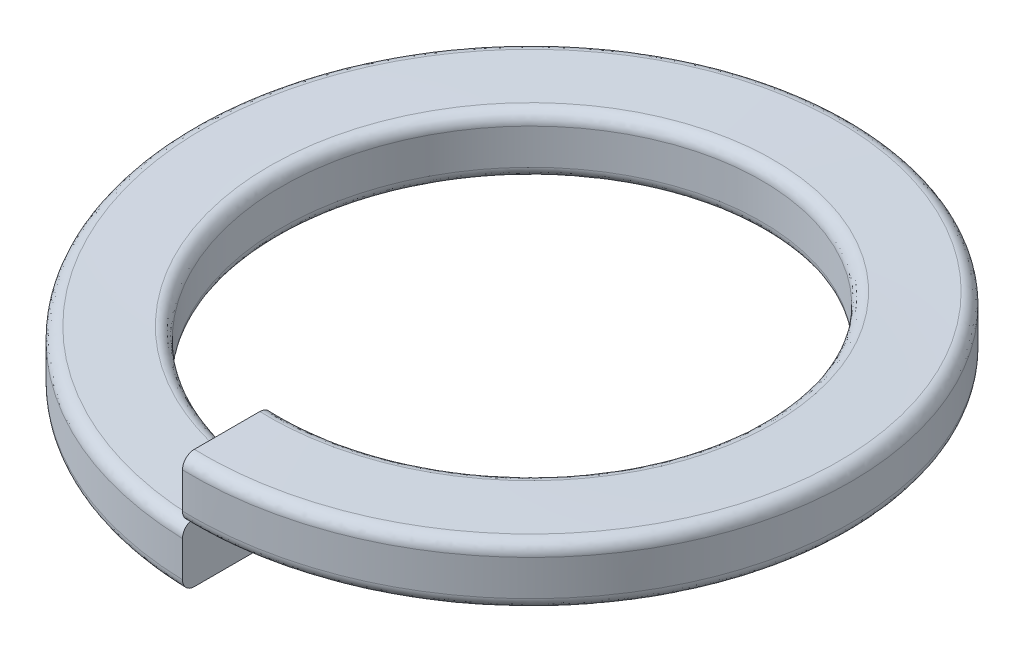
ISO-10303-21;
HEADER;
FILE_DESCRIPTION(('STEP AP214'),'2;1');
FILE_NAME('part.step','',(''),(''),'','','');
FILE_SCHEMA(('AUTOMOTIVE_DESIGN { 1 0 10303 214 1 1 1 1 }'));
ENDSEC;
DATA;
#1=APPLICATION_CONTEXT('core data for automotive mechanical design processes');
#2=APPLICATION_PROTOCOL_DEFINITION('international standard','automotive_design',2000,#1);
#3=PRODUCT_CONTEXT('',#1,'mechanical');
#4=PRODUCT('Part','Part','',(#3));
#5=PRODUCT_RELATED_PRODUCT_CATEGORY('part','',(#4));
#6=PRODUCT_DEFINITION_FORMATION('','',#4);
#7=PRODUCT_DEFINITION_CONTEXT('part definition',#1,'design');
#8=PRODUCT_DEFINITION('design','',#6,#7);
#9=PRODUCT_DEFINITION_SHAPE('','',#8);
#10=(LENGTH_UNIT() NAMED_UNIT(*) SI_UNIT(.MILLI.,.METRE.));
#11=(NAMED_UNIT(*) PLANE_ANGLE_UNIT() SI_UNIT($,.RADIAN.));
#12=(NAMED_UNIT(*) SI_UNIT($,.STERADIAN.) SOLID_ANGLE_UNIT());
#13=UNCERTAINTY_MEASURE_WITH_UNIT(LENGTH_MEASURE(1.E-05),#10,'distance_accuracy_value','');
#14=(GEOMETRIC_REPRESENTATION_CONTEXT(3) GLOBAL_UNCERTAINTY_ASSIGNED_CONTEXT((#13)) GLOBAL_UNIT_ASSIGNED_CONTEXT((#10,
#11,#12)) REPRESENTATION_CONTEXT('',''));
#15=CARTESIAN_POINT('',(0.,0.,0.));
#16=DIRECTION('',(0.,0.,1.));
#17=DIRECTION('',(1.,0.,0.));
#18=AXIS2_PLACEMENT_3D('',#15,#16,#17);
#19=CARTESIAN_POINT('',(0.,0.,4.24));
#20=CARTESIAN_POINT('',(-0.552106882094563,0.0207488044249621,4.23999999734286));
#21=CARTESIAN_POINT('',(-1.10845106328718,0.0415904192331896,4.12982090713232));
#22=CARTESIAN_POINT('',(-2.13646609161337,0.0834401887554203,3.70477616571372));
#23=CARTESIAN_POINT('',(-2.60582295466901,0.104149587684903,3.39069244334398));
#24=CARTESIAN_POINT('',(-3.39053247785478,0.145854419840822,2.60548310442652));
#25=CARTESIAN_POINT('',(-3.70466699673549,0.166633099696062,2.13563475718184));
#26=CARTESIAN_POINT('',(-4.12981396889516,0.208394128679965,1.10956291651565));
#27=CARTESIAN_POINT('',(-4.24001790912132,0.229136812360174,0.555269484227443));
#28=CARTESIAN_POINT('',(-4.23998209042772,0.270877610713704,-0.555281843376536));
#29=CARTESIAN_POINT('',(-4.12974350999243,0.291636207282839,-1.10955940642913));
#30=CARTESIAN_POINT('',(-3.70475645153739,0.333383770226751,-2.13559241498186));
#31=CARTESIAN_POINT('',(-3.39077811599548,0.354136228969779,-2.6054886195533));
#32=CARTESIAN_POINT('',(-2.60548742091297,0.395881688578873,-3.39077685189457));
#33=CARTESIAN_POINT('',(-2.13559246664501,0.416636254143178,-3.70475136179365));
#34=CARTESIAN_POINT('',(-1.10956381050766,0.458382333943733,-4.12974675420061));
#35=CARTESIAN_POINT('',(-0.555283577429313,0.479136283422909,-4.23999995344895));
#36=CARTESIAN_POINT('',(0.555282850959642,0.520882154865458,-4.24000004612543));
#37=CARTESIAN_POINT('',(1.10956310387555,0.541636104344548,-4.12974694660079));
#38=CARTESIAN_POINT('',(2.13559183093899,0.583382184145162,-3.7047517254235));
#39=CARTESIAN_POINT('',(2.60548684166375,0.604136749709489,-3.39077730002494));
#40=CARTESIAN_POINT('',(3.39077766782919,0.645882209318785,-2.60548919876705));
#41=CARTESIAN_POINT('',(3.70475608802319,0.66663466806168,-2.13559305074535));
#42=CARTESIAN_POINT('',(4.12974331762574,0.70838223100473,-1.1095601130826));
#43=CARTESIAN_POINT('',(4.23998199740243,0.729140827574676,-0.55528256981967));
#44=CARTESIAN_POINT('',(4.2400180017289,0.770881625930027,0.55526875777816));
#45=CARTESIAN_POINT('',(4.12981416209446,0.791624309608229,1.10956221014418));
#46=CARTESIAN_POINT('',(3.70466736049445,0.833385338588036,2.13563412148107));
#47=CARTESIAN_POINT('',(3.39053292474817,0.854164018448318,2.60548252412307));
#48=CARTESIAN_POINT('',(2.60582353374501,0.895868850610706,3.39069199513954));
#49=CARTESIAN_POINT('',(2.13646672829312,0.916578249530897,3.70477580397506));
#50=CARTESIAN_POINT('',(1.1084517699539,0.958428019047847,4.12982071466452));
#51=CARTESIAN_POINT('',(0.552107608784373,0.979269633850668,4.23999990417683));
#52=CARTESIAN_POINT('',(7.26372549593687E-07,1.00001843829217,4.23999999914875));
#53=CARTESIAN_POINT('',(0.,0.,5.34));
#54=CARTESIAN_POINT('',(-0.698728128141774,0.0210190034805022,5.33999999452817));
#55=CARTESIAN_POINT('',(-1.39341775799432,0.041367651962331,5.20231281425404));
#56=CARTESIAN_POINT('',(-2.69209201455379,0.0838312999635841,4.665361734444));
#57=CARTESIAN_POINT('',(-3.28103524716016,0.104002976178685,4.2711804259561));
#58=CARTESIAN_POINT('',(-4.27144970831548,0.146023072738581,3.2801352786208));
#59=CARTESIAN_POINT('',(-4.6650028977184,0.166462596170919,2.69157381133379));
#60=CARTESIAN_POINT('',(-5.20191695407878,0.208714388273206,1.39575933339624));
#61=CARTESIAN_POINT('',(-5.34002242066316,0.228968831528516,0.701051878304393));
#62=CARTESIAN_POINT('',(-5.33997757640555,0.271124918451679,-0.701132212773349));
#63=CARTESIAN_POINT('',(-5.2018349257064,0.291469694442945,-1.395736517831));
#64=CARTESIAN_POINT('',(-4.66520839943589,0.333660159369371,-2.69129858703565));
#65=CARTESIAN_POINT('',(-4.27173051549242,0.353968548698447,-3.2801711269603));
#66=CARTESIAN_POINT('',(-3.28017011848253,0.396147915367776,-4.27172908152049));
#67=CARTESIAN_POINT('',(-2.69130086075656,0.416469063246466,-4.66520050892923));
#68=CARTESIAN_POINT('',(-1.39576320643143,0.458651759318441,-5.20183082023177));
#69=CARTESIAN_POINT('',(-0.701142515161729,0.478969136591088,-5.33999969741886));
#70=CARTESIAN_POINT('',(0.701137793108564,0.521150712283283,-5.34000029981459));
#71=CARTESIAN_POINT('',(1.39575861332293,0.541468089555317,-5.20183207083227));
#72=CARTESIAN_POINT('',(2.69129672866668,0.583650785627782,-4.66520287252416));
#73=CARTESIAN_POINT('',(3.28016635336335,0.603971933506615,-4.27173199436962));
#74=CARTESIAN_POINT('',(4.27172760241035,0.646151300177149,-3.28017489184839));
#75=CARTESIAN_POINT('',(4.66520603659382,0.666459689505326,-2.69130271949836));
#76=CARTESIAN_POINT('',(5.20183367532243,0.708650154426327,-1.39574111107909));
#77=CARTESIAN_POINT('',(5.33997697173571,0.728994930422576,-0.701136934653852));
#78=CARTESIAN_POINT('',(5.34002302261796,0.771151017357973,0.701047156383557));
#79=CARTESIAN_POINT('',(5.20191820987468,0.791405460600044,1.39575474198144));
#80=CARTESIAN_POINT('',(4.66500526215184,0.833657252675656,2.69156967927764));
#81=CARTESIAN_POINT('',(4.27145261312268,0.854096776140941,3.28013150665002));
#82=CARTESIAN_POINT('',(3.28103901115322,0.896116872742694,4.27117751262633));
#83=CARTESIAN_POINT('',(2.69209615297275,0.916288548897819,4.66535938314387));
#84=CARTESIAN_POINT('',(1.39342235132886,0.958752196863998,5.20231156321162));
#85=CARTESIAN_POINT('',(0.698732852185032,0.979100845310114,5.3399993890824));
#86=CARTESIAN_POINT('',(4.7214218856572E-06,1.00011984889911,5.3399999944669));
#87=B_SPLINE_SURFACE_WITH_KNOTS('',1,3,((#19,#20,#21,#22,#23,#24,#25,#26,#27,#28,#29,#30,#31,
#32,#33,#34,#35,#36,#37,#38,#39,#40,#41,#42,#43,#44,#45,#46,#47,#48,#49,#50,#51,#52),(#53,#54,
#55,#56,#57,#58,#59,#60,#61,#62,#63,#64,#65,#66,#67,#68,#69,#70,#71,#72,#73,#74,#75,#76,#77,#78,
#79,#80,#81,#82,#83,#84,#85,#86)),.UNSPECIFIED.,.F.,.F.,.F.,(2,2),(4,2,2,2,2,2,2,2,2,2,2,2,2,2,
2,2,4),(0.,1.),(0.,0.0625,0.125000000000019,0.1875,0.25,0.3125,0.375,0.4375,0.5,0.5625,0.625,
0.6875,0.75,0.8125,0.875,0.9375,1.),.UNSPECIFIED.);
#88=DIRECTION('',(0.,0.,1.));
#89=VECTOR('',#88,1.);
#90=CARTESIAN_POINT('',(0.,0.,4.79));
#91=LINE('',#90,#89);
#92=CARTESIAN_POINT('',(0.,0.,4.24));
#93=VERTEX_POINT('',#92);
#94=CARTESIAN_POINT('',(0.,0.,5.34));
#95=VERTEX_POINT('',#94);
#96=EDGE_CURVE('E95',#93,#95,#91,.T.);
#97=CARTESIAN_POINT('',(0.,0.,4.24));
#98=CARTESIAN_POINT('',(-0.552106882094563,0.0207488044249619,4.23999999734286));
#99=CARTESIAN_POINT('',(-1.10845106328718,0.0415904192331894,4.12982090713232));
#100=CARTESIAN_POINT('',(-2.13646609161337,0.0834401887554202,3.70477616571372));
#101=CARTESIAN_POINT('',(-2.60582295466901,0.104149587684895,3.39069244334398));
#102=CARTESIAN_POINT('',(-3.39053247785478,0.145854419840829,2.60548310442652));
#103=CARTESIAN_POINT('',(-3.70466699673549,0.166633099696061,2.13563475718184));
#104=CARTESIAN_POINT('',(-4.12981396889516,0.208394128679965,1.10956291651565));
#105=CARTESIAN_POINT('',(-4.24001790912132,0.229136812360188,0.555269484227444));
#106=CARTESIAN_POINT('',(-4.23998209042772,0.27087761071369,-0.555281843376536));
#107=CARTESIAN_POINT('',(-4.12974350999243,0.291636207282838,-1.10955940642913));
#108=CARTESIAN_POINT('',(-3.70475645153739,0.33338377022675,-2.13559241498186));
#109=CARTESIAN_POINT('',(-3.39077811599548,0.354136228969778,-2.6054886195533));
#110=CARTESIAN_POINT('',(-2.60548742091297,0.395881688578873,-3.39077685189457));
#111=CARTESIAN_POINT('',(-2.13559246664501,0.416636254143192,-3.70475136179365));
#112=CARTESIAN_POINT('',(-1.10956381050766,0.458382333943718,-4.12974675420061));
#113=CARTESIAN_POINT('',(-0.555283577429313,0.479136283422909,-4.23999995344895));
#114=CARTESIAN_POINT('',(0.555282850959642,0.520882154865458,-4.24000004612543));
#115=CARTESIAN_POINT('',(1.10956310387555,0.541636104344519,-4.12974694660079));
#116=CARTESIAN_POINT('',(2.13559183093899,0.58338218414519,-3.7047517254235));
#117=CARTESIAN_POINT('',(2.60548684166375,0.60413674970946,-3.39077730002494));
#118=CARTESIAN_POINT('',(3.39077766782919,0.645882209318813,-2.60548919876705));
#119=CARTESIAN_POINT('',(3.70475608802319,0.666634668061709,-2.13559305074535));
#120=CARTESIAN_POINT('',(4.12974331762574,0.708382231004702,-1.1095601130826));
#121=CARTESIAN_POINT('',(4.23998199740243,0.729140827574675,-0.55528256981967));
#122=CARTESIAN_POINT('',(4.2400180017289,0.770881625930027,0.55526875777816));
#123=CARTESIAN_POINT('',(4.12981416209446,0.791624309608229,1.10956221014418));
#124=CARTESIAN_POINT('',(3.70466736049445,0.833385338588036,2.13563412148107));
#125=CARTESIAN_POINT('',(3.39053292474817,0.854164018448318,2.60548252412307));
#126=CARTESIAN_POINT('',(2.60582353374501,0.895868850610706,3.39069199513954));
#127=CARTESIAN_POINT('',(2.13646672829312,0.916578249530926,3.70477580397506));
#128=CARTESIAN_POINT('',(1.1084517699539,0.958428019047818,4.12982071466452));
#129=CARTESIAN_POINT('',(0.552107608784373,0.979269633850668,4.23999990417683));
#130=CARTESIAN_POINT('',(7.26372549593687E-07,1.00001843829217,4.23999999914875));
#131=B_SPLINE_CURVE_WITH_KNOTS('',3,(#97,#98,#99,#100,#101,#102,#103,#104,#105,#106,#107,#108,
#109,#110,#111,#112,#113,#114,#115,#116,#117,#118,#119,#120,#121,#122,#123,#124,#125,#126,#127,
#128,#129,#130),.UNSPECIFIED.,.F.,.F.,(4,2,2,2,2,2,2,2,2,2,2,2,2,2,2,2,4),(0.,0.0625,
0.125000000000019,0.1875,0.25,0.3125,0.375,0.4375,0.5,0.5625,0.625,0.6875,0.75,0.8125,0.875,
0.9375,1.),.UNSPECIFIED.);
#132=CARTESIAN_POINT('',(7.26372549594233E-07,1.00001843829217,4.23999999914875));
#133=VERTEX_POINT('',#132);
#134=EDGE_CURVE('E103',#93,#133,#131,.T.);
#135=DIRECTION('',(-3.63186303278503E-06,-9.2191460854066E-05,-0.999999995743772));
#136=VECTOR('',#135,1.);
#137=CARTESIAN_POINT('',(2.72389721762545E-06,1.00006914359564,4.78999999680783));
#138=LINE('',#137,#136);
#139=CARTESIAN_POINT('',(4.7214218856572E-06,1.00011984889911,5.3399999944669));
#140=VERTEX_POINT('',#139);
#141=EDGE_CURVE('E155',#140,#133,#138,.T.);
#142=CARTESIAN_POINT('',(0.,0.,5.34));
#143=CARTESIAN_POINT('',(-0.698728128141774,0.021019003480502,5.33999999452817));
#144=CARTESIAN_POINT('',(-1.39341775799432,0.0413676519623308,5.20231281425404));
#145=CARTESIAN_POINT('',(-2.69209201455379,0.0838312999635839,4.665361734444));
#146=CARTESIAN_POINT('',(-3.28103524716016,0.104002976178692,4.2711804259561));
#147=CARTESIAN_POINT('',(-4.27144970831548,0.146023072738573,3.2801352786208));
#148=CARTESIAN_POINT('',(-4.6650028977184,0.166462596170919,2.69157381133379));
#149=CARTESIAN_POINT('',(-5.20191695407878,0.208714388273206,1.39575933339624));
#150=CARTESIAN_POINT('',(-5.34002242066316,0.228968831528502,0.701051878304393));
#151=CARTESIAN_POINT('',(-5.33997757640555,0.271124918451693,-0.701132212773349));
#152=CARTESIAN_POINT('',(-5.2018349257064,0.291469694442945,-1.395736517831));
#153=CARTESIAN_POINT('',(-4.66520839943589,0.333660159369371,-2.69129858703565));
#154=CARTESIAN_POINT('',(-4.27173051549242,0.353968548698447,-3.2801711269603));
#155=CARTESIAN_POINT('',(-3.28017011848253,0.396147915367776,-4.27172908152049));
#156=CARTESIAN_POINT('',(-2.69130086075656,0.41646906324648,-4.66520050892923));
#157=CARTESIAN_POINT('',(-1.39576320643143,0.458651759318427,-5.20183082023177));
#158=CARTESIAN_POINT('',(-0.701142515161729,0.478969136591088,-5.33999969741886));
#159=CARTESIAN_POINT('',(0.701137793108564,0.521150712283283,-5.34000029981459));
#160=CARTESIAN_POINT('',(1.39575861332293,0.541468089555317,-5.20183207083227));
#161=CARTESIAN_POINT('',(2.69129672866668,0.583650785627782,-4.66520287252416));
#162=CARTESIAN_POINT('',(3.28016635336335,0.603971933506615,-4.27173199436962));
#163=CARTESIAN_POINT('',(4.27172760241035,0.646151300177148,-3.28017489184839));
#164=CARTESIAN_POINT('',(4.66520603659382,0.666459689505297,-2.69130271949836));
#165=CARTESIAN_POINT('',(5.20183367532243,0.708650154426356,-1.39574111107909));
#166=CARTESIAN_POINT('',(5.33997697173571,0.728994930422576,-0.701136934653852));
#167=CARTESIAN_POINT('',(5.34002302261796,0.771151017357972,0.701047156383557));
#168=CARTESIAN_POINT('',(5.20191820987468,0.791405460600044,1.39575474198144));
#169=CARTESIAN_POINT('',(4.66500526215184,0.833657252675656,2.69156967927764));
#170=CARTESIAN_POINT('',(4.27145261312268,0.854096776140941,3.28013150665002));
#171=CARTESIAN_POINT('',(3.28103901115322,0.896116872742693,4.27117751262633));
#172=CARTESIAN_POINT('',(2.69209615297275,0.916288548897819,4.66535938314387));
#173=CARTESIAN_POINT('',(1.39342235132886,0.958752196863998,5.20231156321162));
#174=CARTESIAN_POINT('',(0.698732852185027,0.979100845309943,5.3399993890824));
#175=CARTESIAN_POINT('',(4.7214218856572E-06,1.00011984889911,5.3399999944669));
#176=B_SPLINE_CURVE_WITH_KNOTS('',3,(#142,#143,#144,#145,#146,#147,#148,#149,#150,#151,#152,
#153,#154,#155,#156,#157,#158,#159,#160,#161,#162,#163,#164,#165,#166,#167,#168,#169,#170,#171,
#172,#173,#174,#175),.UNSPECIFIED.,.F.,.F.,(4,2,2,2,2,2,2,2,2,2,2,2,2,2,2,2,4),(0.,0.0625,
0.125000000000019,0.1875,0.25,0.3125,0.375,0.4375,0.5,0.5625,0.625,0.6875,0.75,0.8125,0.875,
0.9375,1.),.UNSPECIFIED.);
#177=EDGE_CURVE('E91',#140,#95,#176,.F.);
#178=ORIENTED_EDGE('',*,*,#96,.F.);
#179=ORIENTED_EDGE('',*,*,#134,.T.);
#180=ORIENTED_EDGE('',*,*,#141,.F.);
#181=ORIENTED_EDGE('',*,*,#177,.T.);
#182=EDGE_LOOP('',(#178,#179,#180,#181));
#183=FACE_BOUND('',#182,.T.);
#184=ADVANCED_FACE('F17',(#183),#87,.F.);
#185=CARTESIAN_POINT('',(0.,0.,5.34));
#186=CARTESIAN_POINT('',(-0.698728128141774,0.021019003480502,5.33999999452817));
#187=CARTESIAN_POINT('',(-1.39341775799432,0.0413676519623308,5.20231281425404));
#188=CARTESIAN_POINT('',(-2.69209201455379,0.0838312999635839,4.665361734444));
#189=CARTESIAN_POINT('',(-3.28103524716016,0.104002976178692,4.2711804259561));
#190=CARTESIAN_POINT('',(-4.27144970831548,0.146023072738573,3.2801352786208));
#191=CARTESIAN_POINT('',(-4.6650028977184,0.166462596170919,2.69157381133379));
#192=CARTESIAN_POINT('',(-5.20191695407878,0.208714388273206,1.39575933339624));
#193=CARTESIAN_POINT('',(-5.34002242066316,0.228968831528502,0.701051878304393));
#194=CARTESIAN_POINT('',(-5.33997757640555,0.271124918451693,-0.701132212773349));
#195=CARTESIAN_POINT('',(-5.2018349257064,0.291469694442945,-1.395736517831));
#196=CARTESIAN_POINT('',(-4.66520839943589,0.333660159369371,-2.69129858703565));
#197=CARTESIAN_POINT('',(-4.27173051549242,0.353968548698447,-3.2801711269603));
#198=CARTESIAN_POINT('',(-3.28017011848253,0.396147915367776,-4.27172908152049));
#199=CARTESIAN_POINT('',(-2.69130086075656,0.41646906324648,-4.66520050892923));
#200=CARTESIAN_POINT('',(-1.39576320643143,0.458651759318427,-5.20183082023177));
#201=CARTESIAN_POINT('',(-0.701142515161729,0.478969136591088,-5.33999969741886));
#202=CARTESIAN_POINT('',(0.701137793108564,0.521150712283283,-5.34000029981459));
#203=CARTESIAN_POINT('',(1.39575861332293,0.541468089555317,-5.20183207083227));
#204=CARTESIAN_POINT('',(2.69129672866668,0.583650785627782,-4.66520287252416));
#205=CARTESIAN_POINT('',(3.28016635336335,0.603971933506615,-4.27173199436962));
#206=CARTESIAN_POINT('',(4.27172760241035,0.646151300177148,-3.28017489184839));
#207=CARTESIAN_POINT('',(4.66520603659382,0.666459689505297,-2.69130271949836));
#208=CARTESIAN_POINT('',(5.20183367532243,0.708650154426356,-1.39574111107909));
#209=CARTESIAN_POINT('',(5.33997697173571,0.728994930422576,-0.701136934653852));
#210=CARTESIAN_POINT('',(5.34002302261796,0.771151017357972,0.701047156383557));
#211=CARTESIAN_POINT('',(5.20191820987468,0.791405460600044,1.39575474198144));
#212=CARTESIAN_POINT('',(4.66500526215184,0.833657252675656,2.69156967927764));
#213=CARTESIAN_POINT('',(4.27145261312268,0.854096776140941,3.28013150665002));
#214=CARTESIAN_POINT('',(3.28103901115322,0.896116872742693,4.27117751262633));
#215=CARTESIAN_POINT('',(2.69209615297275,0.916288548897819,4.66535938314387));
#216=CARTESIAN_POINT('',(1.39342235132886,0.958752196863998,5.20231156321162));
#217=CARTESIAN_POINT('',(0.698732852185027,0.979100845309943,5.3399993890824));
#218=CARTESIAN_POINT('',(4.7214218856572E-06,1.00011984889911,5.3399999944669));
#219=CARTESIAN_POINT('',(0.,0.,5.45715728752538));
#220=CARTESIAN_POINT('',(-0.714344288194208,0.0210478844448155,5.45715728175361));
#221=CARTESIAN_POINT('',(-1.42376859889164,0.0413439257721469,5.31654030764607));
#222=CARTESIAN_POINT('',(-2.75126985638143,0.0838729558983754,4.7676704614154));
#223=CARTESIAN_POINT('',(-3.35294982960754,0.103987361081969,4.36495822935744));
#224=CARTESIAN_POINT('',(-4.36527322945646,0.146041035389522,3.35199020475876));
#225=CARTESIAN_POINT('',(-4.7672850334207,0.166444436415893,2.75078500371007));
#226=CARTESIAN_POINT('',(-5.31610302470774,0.208748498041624,1.42624114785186));
#227=CARTESIAN_POINT('',(-5.45718018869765,0.228950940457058,0.716578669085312));
#228=CARTESIAN_POINT('',(-5.45713438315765,0.271151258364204,-0.716666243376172));
#229=CARTESIAN_POINT('',(-5.31601976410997,0.291451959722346,-1.42621627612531));
#230=CARTESIAN_POINT('',(-4.76750289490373,0.333689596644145,-2.75048497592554));
#231=CARTESIAN_POINT('',(-4.36555778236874,0.353950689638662,-3.35202928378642));
#232=CARTESIAN_POINT('',(-3.3520282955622,0.396176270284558,-4.3655563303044));
#233=CARTESIAN_POINT('',(-2.75048748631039,0.416451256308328,-4.76749470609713));
#234=CARTESIAN_POINT('',(-1.4262453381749,0.458680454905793,-5.31601487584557));
#235=CARTESIAN_POINT('',(-0.716677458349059,0.478951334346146,-5.45715695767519));
#236=CARTESIAN_POINT('',(0.716672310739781,0.521179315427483,-5.4571576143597));
#237=CARTESIAN_POINT('',(1.42624033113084,0.541450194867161,-5.31601623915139));
#238=CARTESIAN_POINT('',(2.75048298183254,0.583679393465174,-4.76749728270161));
#239=CARTESIAN_POINT('',(3.35202419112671,0.603954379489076,-4.36555950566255));
#240=CARTESIAN_POINT('',(4.36555460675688,0.64617996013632,-3.3520333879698));
#241=CARTESIAN_POINT('',(4.76750031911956,0.66644105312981,-2.75048948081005));
#242=CARTESIAN_POINT('',(5.3160184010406,0.708678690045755,-1.42622128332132));
#243=CARTESIAN_POINT('',(5.45713372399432,0.728979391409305,-0.716671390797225));
#244=CARTESIAN_POINT('',(5.45718084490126,0.771179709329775,0.716573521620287));
#245=CARTESIAN_POINT('',(5.31610439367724,0.791382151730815,1.42623614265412));
#246=CARTESIAN_POINT('',(4.7672876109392,0.833686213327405,2.75078049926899));
#247=CARTESIAN_POINT('',(4.36527639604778,0.854089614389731,3.35198609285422));
#248=CARTESIAN_POINT('',(3.35295393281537,0.896143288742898,4.36495505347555));
#249=CARTESIAN_POINT('',(2.75127436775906,0.916257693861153,4.76766789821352));
#250=CARTESIAN_POINT('',(1.4237736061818,0.958786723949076,5.31653894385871));
#251=CARTESIAN_POINT('',(0.714349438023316,0.979082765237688,5.45715662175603));
#252=CARTESIAN_POINT('',(5.14692110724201E-06,1.0001306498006,5.45715728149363));
#253=CARTESIAN_POINT('',(0.,-0.0828427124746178,5.54));
#254=CARTESIAN_POINT('',(-0.725390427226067,-0.0617743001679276,5.54002067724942));
#255=CARTESIAN_POINT('',(-1.44522395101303,-0.0415155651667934,5.39729578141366));
#256=CARTESIAN_POINT('',(-2.7931274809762,0.00105970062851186,4.8400401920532));
#257=CARTESIAN_POINT('',(-3.40379293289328,0.021133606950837,4.43126171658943));
#258=CARTESIAN_POINT('',(-4.43162580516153,0.0632110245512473,3.40280794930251));
#259=CARTESIAN_POINT('',(-4.83959771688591,0.083588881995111,2.79264859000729));
#260=CARTESIAN_POINT('',(-5.39686742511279,0.125929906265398,1.44780313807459));
#261=CARTESIAN_POINT('',(-5.54001063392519,0.146095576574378,0.727557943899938));
#262=CARTESIAN_POINT('',(-5.53999533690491,0.188327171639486,-0.727651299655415));
#263=CARTESIAN_POINT('',(-5.39674912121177,0.208596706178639,-1.44776391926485));
#264=CARTESIAN_POINT('',(-4.83985482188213,0.250867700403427,-2.79234492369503));
#265=CARTESIAN_POINT('',(-4.43189484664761,0.271095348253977,-3.40283172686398));
#266=CARTESIAN_POINT('',(-3.40285317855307,0.313353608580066,-4.43191701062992));
#267=CARTESIAN_POINT('',(-2.79233401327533,0.333595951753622,-4.83981602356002));
#268=CARTESIAN_POINT('',(-1.44780632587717,0.375858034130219,-5.39677425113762));
#269=CARTESIAN_POINT('',(-0.727662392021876,0.396096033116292,-5.5399871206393));
#270=CARTESIAN_POINT('',(0.727657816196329,0.438356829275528,-5.54002051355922));
#271=CARTESIAN_POINT('',(1.44778928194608,0.458594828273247,-5.39674502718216));
#272=CARTESIAN_POINT('',(2.79234257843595,0.500856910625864,-4.83984862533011));
#273=CARTESIAN_POINT('',(3.4028265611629,0.521099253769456,-4.43189689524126));
#274=CARTESIAN_POINT('',(4.43191526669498,0.563357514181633,-3.40285864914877));
#275=CARTESIAN_POINT('',(4.83982117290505,0.583585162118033,-2.79233584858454));
#276=CARTESIAN_POINT('',(5.39677815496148,0.625856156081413,-1.44778080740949));
#277=CARTESIAN_POINT('',(5.53996511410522,0.646125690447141,-0.727656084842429));
#278=CARTESIAN_POINT('',(5.5400441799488,0.688357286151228,0.727553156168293));
#279=CARTESIAN_POINT('',(5.39683100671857,0.708522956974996,1.44778364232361));
#280=CARTESIAN_POINT('',(4.83963052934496,0.750863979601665,2.792657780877));
#281=CARTESIAN_POINT('',(4.43161661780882,0.771241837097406,3.40279100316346));
#282=CARTESIAN_POINT('',(3.40381833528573,0.813319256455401,4.43127933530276));
#283=CARTESIAN_POINT('',(2.79311097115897,0.833393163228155,4.83999107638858));
#284=CARTESIAN_POINT('',(1.44524309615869,0.875968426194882,5.39733290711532));
#285=CARTESIAN_POINT('',(0.725389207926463,0.896227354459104,5.53998624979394));
#286=CARTESIAN_POINT('',(5.44780836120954E-06,0.917295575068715,5.54000763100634));
#287=CARTESIAN_POINT('',(0.,-0.2,5.54));
#288=CARTESIAN_POINT('',(-0.725395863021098,-0.178931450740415,5.54004992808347));
#289=CARTESIAN_POINT('',(-1.44521556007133,-0.158672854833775,5.3972737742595));
#290=CARTESIAN_POINT('',(-2.79314525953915,-0.116097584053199,4.84007771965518));
#291=CARTESIAN_POINT('',(-3.40378135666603,-0.0960236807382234,4.4312512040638));
#292=CARTESIAN_POINT('',(-4.43163899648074,-0.0539462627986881,3.40282016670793));
#293=CARTESIAN_POINT('',(-4.83958115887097,-0.0335684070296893,2.79264144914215));
#294=CARTESIAN_POINT('',(-5.39689946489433,0.00877262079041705,1.44781458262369));
#295=CARTESIAN_POINT('',(-5.53999280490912,0.0289382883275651,0.727558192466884));
#296=CARTESIAN_POINT('',(-5.54002161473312,0.0711698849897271,-0.727652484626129));
#297=CARTESIAN_POINT('',(-5.39673283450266,0.0914394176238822,-1.44775713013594));
#298=CARTESIAN_POINT('',(-4.83988140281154,0.133710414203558,-2.79235744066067));
#299=CARTESIAN_POINT('',(-4.43188235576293,0.153938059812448,-3.40281907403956));
#300=CARTESIAN_POINT('',(-3.40287224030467,0.196196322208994,-4.43193793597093));
#301=CARTESIAN_POINT('',(-2.79232731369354,0.216438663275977,-4.8397996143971));
#302=CARTESIAN_POINT('',(-1.44781603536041,0.258700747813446,-5.39680119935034));
#303=CARTESIAN_POINT('',(-0.727662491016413,0.278938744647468,-5.53996940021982));
#304=CARTESIAN_POINT('',(0.727659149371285,0.321199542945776,-5.5400490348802));
#305=CARTESIAN_POINT('',(1.44778238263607,0.341437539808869,-5.39672860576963));
#306=CARTESIAN_POINT('',(2.792354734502,0.383699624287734,-4.83987446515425));
#307=CARTESIAN_POINT('',(3.40281412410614,0.403941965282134,-4.43188461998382));
#308=CARTESIAN_POINT('',(4.43193640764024,0.446200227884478,-3.40287792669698));
#309=CARTESIAN_POINT('',(4.83980402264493,0.466427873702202,-2.79232878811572));
#310=CARTESIAN_POINT('',(5.39680496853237,0.508698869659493,-1.44779040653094));
#311=CARTESIAN_POINT('',(5.53994963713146,0.528968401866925,-0.727656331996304));
#312=CARTESIAN_POINT('',(5.54007280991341,0.571200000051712,0.727554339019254));
#313=CARTESIAN_POINT('',(5.39680949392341,0.591365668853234,1.44777500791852));
#314=CARTESIAN_POINT('',(4.83965651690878,0.633706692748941,2.79267038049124));
#315=CARTESIAN_POINT('',(4.43161207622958,0.654084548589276,3.40278541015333));
#316=CARTESIAN_POINT('',(3.40383654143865,0.696161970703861,4.43129849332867));
#317=CARTESIAN_POINT('',(2.79309864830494,0.716235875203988,4.83996298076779));
#318=CARTESIAN_POINT('',(1.44525428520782,0.758811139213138,5.39736544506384));
#319=CARTESIAN_POINT('',(0.725385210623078,0.779070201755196,5.53996780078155));
#320=CARTESIAN_POINT('',(5.44782797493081E-06,0.800138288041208,5.54001843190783));
#321=(BOUNDED_SURFACE() B_SPLINE_SURFACE(3,3,((#185,#186,#187,#188,#189,#190,#191,#192,#193,
#194,#195,#196,#197,#198,#199,#200,#201,#202,#203,#204,#205,#206,#207,#208,#209,#210,#211,#212,
#213,#214,#215,#216,#217,#218),(#219,#220,#221,#222,#223,#224,#225,#226,#227,#228,#229,#230,
#231,#232,#233,#234,#235,#236,#237,#238,#239,#240,#241,#242,#243,#244,#245,#246,#247,#248,#249,
#250,#251,#252),(#253,#254,#255,#256,#257,#258,#259,#260,#261,#262,#263,#264,#265,#266,#267,
#268,#269,#270,#271,#272,#273,#274,#275,#276,#277,#278,#279,#280,#281,#282,#283,#284,#285,#286),
(#287,#288,#289,#290,#291,#292,#293,#294,#295,#296,#297,#298,#299,#300,#301,#302,#303,#304,#305,
#306,#307,#308,#309,#310,#311,#312,#313,#314,#315,#316,#317,#318,#319,#320)),.UNSPECIFIED.,.F.,
.F.,.F.) B_SPLINE_SURFACE_WITH_KNOTS((4,4),(4,2,2,2,2,2,2,2,2,2,2,2,2,2,2,2,4),(0.,1.),(0.,
0.0625,0.125000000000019,0.1875,0.25,0.3125,0.375,0.4375,0.5,0.5625,0.625,0.6875,0.75,0.8125,
0.875,0.9375,1.),.UNSPECIFIED.) GEOMETRIC_REPRESENTATION_ITEM() RATIONAL_B_SPLINE_SURFACE(((1.,
1.,1.,1.,1.,1.,1.,1.,1.,1.,1.,1.,1.,1.,1.,1.,1.,1.,1.,1.,1.,1.,1.,1.,1.,1.,1.,1.,1.,1.,1.,1.,1.,
1.),(0.804737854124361,0.804737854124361,0.804737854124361,0.804737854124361,0.804737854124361,
0.804737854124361,0.804737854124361,0.804737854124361,0.804737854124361,0.804737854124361,
0.804737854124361,0.804737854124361,0.804737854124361,0.804737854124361,0.804737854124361,
0.804737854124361,0.804737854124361,0.804737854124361,0.804737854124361,0.804737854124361,
0.804737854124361,0.804737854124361,0.804737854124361,0.804737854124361,0.804737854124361,
0.804737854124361,0.804737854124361,0.804737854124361,0.804737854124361,0.804737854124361,
0.804737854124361,0.804737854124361,0.804737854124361,0.804737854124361),(0.804737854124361,
0.804737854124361,0.804737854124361,0.804737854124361,0.804737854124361,0.804737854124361,
0.804737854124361,0.804737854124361,0.804737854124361,0.804737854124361,0.804737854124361,
0.804737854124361,0.804737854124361,0.804737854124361,0.804737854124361,0.804737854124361,
0.804737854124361,0.804737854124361,0.804737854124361,0.804737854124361,0.804737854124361,
0.804737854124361,0.804737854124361,0.804737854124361,0.804737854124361,0.804737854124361,
0.804737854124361,0.804737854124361,0.804737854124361,0.804737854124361,0.804737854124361,
0.804737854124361,0.804737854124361,0.804737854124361),(1.,1.,1.,1.,1.,1.,1.,1.,1.,1.,1.,1.,1.,
1.,1.,1.,1.,1.,1.,1.,1.,1.,1.,1.,1.,1.,1.,1.,1.,1.,1.,1.,1.,1.))) REPRESENTATION_ITEM('') SURFACE());
#322=CARTESIAN_POINT('',(0.,0.,5.34));
#323=CARTESIAN_POINT('',(0.,9.55617309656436E-06,5.351251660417));
#324=CARTESIAN_POINT('',(0.,-0.000948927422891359,5.36250046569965));
#325=CARTESIAN_POINT('',(0.,-0.00473145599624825,5.38467126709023));
#326=CARTESIAN_POINT('',(0.,-0.00755403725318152,5.39559351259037));
#327=CARTESIAN_POINT('',(0.,-0.0149962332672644,5.4168138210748));
#328=CARTESIAN_POINT('',(0.,-0.0196167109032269,5.42711158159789));
#329=CARTESIAN_POINT('',(0.,-0.0305195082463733,5.44678358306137));
#330=CARTESIAN_POINT('',(0.,-0.0368015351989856,5.45615798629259));
#331=CARTESIAN_POINT('',(0.,-0.0508509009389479,5.47371998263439));
#332=CARTESIAN_POINT('',(0.,-0.0586183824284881,5.48190746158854));
#333=CARTESIAN_POINT('',(0.,-0.0754177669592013,5.49686206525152));
#334=CARTESIAN_POINT('',(0.,-0.0844496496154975,5.50362921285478));
#335=CARTESIAN_POINT('',(0.,-0.103523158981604,5.51555284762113));
#336=CARTESIAN_POINT('',(0.,-0.113565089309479,5.52070884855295));
#337=CARTESIAN_POINT('',(0.,-0.134370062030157,5.52925909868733));
#338=CARTESIAN_POINT('',(0.,-0.145132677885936,5.53265437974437));
#339=CARTESIAN_POINT('',(0.,-0.163300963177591,5.53674302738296));
#340=CARTESIAN_POINT('',(0.,-0.170592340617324,5.53796365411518));
#341=CARTESIAN_POINT('',(0.,-0.185254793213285,5.53959203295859));
#342=CARTESIAN_POINT('',(0.,-0.192625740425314,5.54000093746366));
#343=CARTESIAN_POINT('',(0.,-0.2,5.54));
#344=B_SPLINE_CURVE_WITH_KNOTS('',3,(#322,#323,#324,#325,#326,#327,#328,#329,#330,#331,#332,
#333,#334,#335,#336,#337,#338,#339,#340,#341,#342,#343),.UNSPECIFIED.,.F.,.F.,(4,2,2,2,2,2,2,2,
2,2,4),(0.,0.0337101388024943,0.0673938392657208,0.10109372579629,0.134787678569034,
0.168484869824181,0.202181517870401,0.235888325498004,0.269575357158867,0.291711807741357,
0.313816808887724),.UNSPECIFIED.);
#345=CARTESIAN_POINT('',(0.,-0.2,5.54));
#346=VERTEX_POINT('',#345);
#347=EDGE_CURVE('E160',#95,#346,#344,.T.);
#348=CARTESIAN_POINT('',(5.44782797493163E-06,0.800138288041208,5.54001843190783));
#349=CARTESIAN_POINT('',(5.44786079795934E-06,0.811389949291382,5.5400269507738));
#350=CARTESIAN_POINT('',(5.44437783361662E-06,0.82263866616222,5.5390674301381));
#351=CARTESIAN_POINT('',(5.43063649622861E-06,0.844809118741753,5.53528285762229));
#352=CARTESIAN_POINT('',(5.42038343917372E-06,0.855731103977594,5.53245926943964));
#353=CARTESIAN_POINT('',(5.39335085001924E-06,0.87695072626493,5.52501511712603));
#354=CARTESIAN_POINT('',(5.37656818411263E-06,0.887248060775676,5.52039369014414));
#355=CARTESIAN_POINT('',(5.33696742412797E-06,0.906919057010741,5.50948907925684));
#356=CARTESIAN_POINT('',(5.31415039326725E-06,0.916292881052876,5.50320618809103));
#357=CARTESIAN_POINT('',(5.26312208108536E-06,0.933853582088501,5.48915520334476));
#358=CARTESIAN_POINT('',(5.23491028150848E-06,0.942040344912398,5.48138696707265));
#359=CARTESIAN_POINT('',(5.17389471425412E-06,0.956993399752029,5.46458620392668));
#360=CARTESIAN_POINT('',(5.14109102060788E-06,0.963759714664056,5.45555369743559));
#361=CARTESIAN_POINT('',(5.07181665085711E-06,0.975681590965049,5.43647908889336));
#362=CARTESIAN_POINT('',(5.03534487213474E-06,0.980836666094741,5.42643668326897));
#363=CARTESIAN_POINT('',(4.95978262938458E-06,0.989384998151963,5.40563092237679));
#364=CARTESIAN_POINT('',(4.92069371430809E-06,0.992779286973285,5.3948679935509));
#365=CARTESIAN_POINT('',(4.85470830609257E-06,0.996866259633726,5.37669933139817));
#366=CARTESIAN_POINT('',(4.82822681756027E-06,0.998086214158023,5.36940784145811));
#367=CARTESIAN_POINT('',(4.77497452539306E-06,0.999713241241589,5.35474523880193));
#368=CARTESIAN_POINT('',(4.74820418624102E-06,1.00012146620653,5.34737425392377));
#369=CARTESIAN_POINT('',(4.7214218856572E-06,1.00011984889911,5.3399999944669));
#370=B_SPLINE_CURVE_WITH_KNOTS('',3,(#348,#349,#350,#351,#352,#353,#354,#355,#356,#357,#358,
#359,#360,#361,#362,#363,#364,#365,#366,#367,#368,#369),.UNSPECIFIED.,.F.,.F.,(4,2,2,2,2,2,2,2,
2,2,4),(0.,0.0337101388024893,0.0673938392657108,0.101093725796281,0.134787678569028,
0.168484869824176,0.202181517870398,0.235888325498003,0.269575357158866,0.291711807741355,
0.31381680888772),.UNSPECIFIED.);
#371=CARTESIAN_POINT('',(5.44782797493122E-06,0.800138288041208,5.54001843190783));
#372=VERTEX_POINT('',#371);
#373=EDGE_CURVE('E23',#372,#140,#370,.T.);
#374=CARTESIAN_POINT('',(0.,-0.2,5.54));
#375=CARTESIAN_POINT('',(-0.725395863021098,-0.178931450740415,5.54004992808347));
#376=CARTESIAN_POINT('',(-1.44521556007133,-0.158672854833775,5.3972737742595));
#377=CARTESIAN_POINT('',(-2.79314525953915,-0.116097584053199,4.84007771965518));
#378=CARTESIAN_POINT('',(-3.40378135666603,-0.0960236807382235,4.4312512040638));
#379=CARTESIAN_POINT('',(-4.43163899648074,-0.0539462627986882,3.40282016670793));
#380=CARTESIAN_POINT('',(-4.83958115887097,-0.0335684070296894,2.79264144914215));
#381=CARTESIAN_POINT('',(-5.39689946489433,0.00877262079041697,1.44781458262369));
#382=CARTESIAN_POINT('',(-5.53999280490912,0.028938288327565,0.727558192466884));
#383=CARTESIAN_POINT('',(-5.54002161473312,0.071169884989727,-0.727652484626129));
#384=CARTESIAN_POINT('',(-5.39673283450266,0.0914394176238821,-1.44775713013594));
#385=CARTESIAN_POINT('',(-4.83988140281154,0.133710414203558,-2.79235744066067));
#386=CARTESIAN_POINT('',(-4.43188235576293,0.153938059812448,-3.40281907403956));
#387=CARTESIAN_POINT('',(-3.40287224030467,0.196196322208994,-4.43193793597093));
#388=CARTESIAN_POINT('',(-2.79232731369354,0.216438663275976,-4.8397996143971));
#389=CARTESIAN_POINT('',(-1.44781603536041,0.258700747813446,-5.39680119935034));
#390=CARTESIAN_POINT('',(-0.727662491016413,0.278938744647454,-5.53996940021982));
#391=CARTESIAN_POINT('',(0.727659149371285,0.321199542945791,-5.5400490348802));
#392=CARTESIAN_POINT('',(1.44778238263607,0.341437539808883,-5.39672860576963));
#393=CARTESIAN_POINT('',(2.792354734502,0.383699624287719,-4.83987446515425));
#394=CARTESIAN_POINT('',(3.40281412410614,0.403941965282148,-4.43188461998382));
#395=CARTESIAN_POINT('',(4.43193640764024,0.446200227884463,-3.40287792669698));
#396=CARTESIAN_POINT('',(4.83980402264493,0.466427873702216,-2.79232878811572));
#397=CARTESIAN_POINT('',(5.39680496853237,0.508698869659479,-1.44779040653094));
#398=CARTESIAN_POINT('',(5.53994963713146,0.528968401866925,-0.727656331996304));
#399=CARTESIAN_POINT('',(5.54007280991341,0.571200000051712,0.727554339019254));
#400=CARTESIAN_POINT('',(5.39680949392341,0.591365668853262,1.44777500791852));
#401=CARTESIAN_POINT('',(4.83965651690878,0.633706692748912,2.79267038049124));
#402=CARTESIAN_POINT('',(4.43161207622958,0.654084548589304,3.40278541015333));
#403=CARTESIAN_POINT('',(3.40383654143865,0.696161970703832,4.43129849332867));
#404=CARTESIAN_POINT('',(2.79309864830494,0.716235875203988,4.83996298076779));
#405=CARTESIAN_POINT('',(1.44525428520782,0.758811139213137,5.39736544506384));
#406=CARTESIAN_POINT('',(0.725385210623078,0.779070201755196,5.53996780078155));
#407=CARTESIAN_POINT('',(5.44782797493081E-06,0.800138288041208,5.54001843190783));
#408=B_SPLINE_CURVE_WITH_KNOTS('',3,(#374,#375,#376,#377,#378,#379,#380,#381,#382,#383,#384,
#385,#386,#387,#388,#389,#390,#391,#392,#393,#394,#395,#396,#397,#398,#399,#400,#401,#402,#403,
#404,#405,#406,#407),.UNSPECIFIED.,.F.,.F.,(4,2,2,2,2,2,2,2,2,2,2,2,2,2,2,2,4),(0.,0.0625,
0.125000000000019,0.1875,0.25,0.3125,0.375,0.4375,0.5,0.5625,0.625,0.6875,0.75,0.8125,0.875,
0.9375,1.),.UNSPECIFIED.);
#409=EDGE_CURVE('E89',#372,#346,#408,.F.);
#410=ORIENTED_EDGE('',*,*,#347,.F.);
#411=ORIENTED_EDGE('',*,*,#177,.F.);
#412=ORIENTED_EDGE('',*,*,#373,.F.);
#413=ORIENTED_EDGE('',*,*,#409,.T.);
#414=EDGE_LOOP('',(#410,#411,#412,#413));
#415=FACE_BOUND('',#414,.T.);
#416=ADVANCED_FACE('F88',(#415),#321,.F.);
#417=CARTESIAN_POINT('',(0.,-0.2,4.04));
#418=CARTESIAN_POINT('',(-0.525457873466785,-0.179299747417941,4.04004994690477));
#419=CARTESIAN_POINT('',(-1.05662461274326,-0.158369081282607,3.93478481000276));
#420=CARTESIAN_POINT('',(-2.03547354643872,-0.116630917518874,3.5301883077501));
#421=CARTESIAN_POINT('',(-2.48303732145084,-0.0958237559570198,3.23058577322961));
#422=CARTESIAN_POINT('',(-3.23038822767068,-0.0541762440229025,2.48283992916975));
#423=CARTESIAN_POINT('',(-3.53003220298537,-0.0333359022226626,2.03454273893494));
#424=CARTESIAN_POINT('',(-3.93494084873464,0.00833590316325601,1.05754674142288));
#425=CARTESIAN_POINT('',(-4.03998665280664,0.029167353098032,0.528764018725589));
#426=CARTESIAN_POINT('',(-4.04002777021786,0.0708326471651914,-0.528765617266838));
#427=CARTESIAN_POINT('',(-3.93478999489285,0.0916664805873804,-1.05751561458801));
#428=CARTESIAN_POINT('',(-3.53017420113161,0.133333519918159,-2.03457629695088));
#429=CARTESIAN_POINT('',(-3.23058362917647,0.154166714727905,-2.4827974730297));
#430=CARTESIAN_POINT('',(-2.48285037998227,0.195833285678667,-3.23063944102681));
#431=CARTESIAN_POINT('',(-2.03454313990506,0.216666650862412,-3.53009623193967));
#432=CARTESIAN_POINT('',(-1.057544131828,0.258333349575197,-3.93486838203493));
#433=CARTESIAN_POINT('',(-0.528763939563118,0.279166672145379,-4.03996974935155));
#434=CARTESIAN_POINT('',(0.528766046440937,0.320833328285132,-4.04004868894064));
#435=CARTESIAN_POINT('',(1.05751577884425,0.341666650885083,-3.93479434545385));
#436=CARTESIAN_POINT('',(2.03457532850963,0.383333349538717,-3.53016835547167));
#437=CARTESIAN_POINT('',(2.48279660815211,0.404166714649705,-3.23058276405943));
#438=CARTESIAN_POINT('',(3.23064104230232,0.445833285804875,-2.48285198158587));
#439=CARTESIAN_POINT('',(3.53009954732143,0.466666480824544,-2.03454287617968));
#440=CARTESIAN_POINT('',(3.93486357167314,0.508333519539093,-1.05754359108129));
#441=CARTESIAN_POINT('',(4.03995649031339,0.52916735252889,-0.528764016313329));
#442=CARTESIAN_POINT('',(4.04006596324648,0.570832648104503,0.528765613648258));
#443=CARTESIAN_POINT('',(3.93484942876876,0.591664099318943,1.05751246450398));
#444=CARTESIAN_POINT('',(3.53010483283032,0.633335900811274,2.03457643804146));
#445=CARTESIAN_POINT('',(3.23035795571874,0.654176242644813,2.48280952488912));
#446=CARTESIAN_POINT('',(2.48308816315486,0.695823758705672,3.23063642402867));
#447=CARTESIAN_POINT('',(2.03542216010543,0.716630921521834,3.53007628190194));
#448=CARTESIAN_POINT('',(1.05665803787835,0.758369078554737,3.93487792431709));
#449=CARTESIAN_POINT('',(0.525441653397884,0.779300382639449,4.03996848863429));
#450=CARTESIAN_POINT('',(3.34257532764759E-11,0.800000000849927,4.04001843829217));
#451=CARTESIAN_POINT('',(0.,-0.0828427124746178,4.04));
#452=CARTESIAN_POINT('',(-0.525452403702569,-0.0621426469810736,4.04002068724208));
#453=CARTESIAN_POINT('',(-1.05663300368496,-0.0412117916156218,3.9348068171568));
#454=CARTESIAN_POINT('',(-2.03545576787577,0.000526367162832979,3.53015078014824));
#455=CARTESIAN_POINT('',(-2.48304889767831,0.0213335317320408,3.23059628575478));
#456=CARTESIAN_POINT('',(-3.23037503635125,0.0629810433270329,2.4828277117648));
#457=CARTESIAN_POINT('',(-3.53004876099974,0.0838213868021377,2.03454987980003));
#458=CARTESIAN_POINT('',(-3.93490880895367,0.125493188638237,1.05753529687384));
#459=CARTESIAN_POINT('',(-4.0400044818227,0.146324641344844,0.528763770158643));
#460=CARTESIAN_POINT('',(-4.04000149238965,0.187989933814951,-0.528764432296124));
#461=CARTESIAN_POINT('',(-3.93480628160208,0.208823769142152,-1.05752240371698));
#462=CARTESIAN_POINT('',(-3.53014762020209,0.250490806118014,-2.03456377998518));
#463=CARTESIAN_POINT('',(-3.23059612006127,0.271324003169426,-2.48281012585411));
#464=CARTESIAN_POINT('',(-2.48283131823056,0.312990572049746,-3.2306185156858));
#465=CARTESIAN_POINT('',(-2.03454983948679,0.333823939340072,-3.53011264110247));
#466=CARTESIAN_POINT('',(-1.05753442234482,0.375490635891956,-3.93484143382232));
#467=CARTESIAN_POINT('',(-0.528763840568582,0.396323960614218,-4.03998746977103));
#468=CARTESIAN_POINT('',(0.528764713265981,0.43799061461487,-4.04002016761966));
#469=CARTESIAN_POINT('',(1.05752267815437,0.458823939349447,-3.93481076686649));
#470=CARTESIAN_POINT('',(2.03456317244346,0.500490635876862,-3.5301425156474));
#471=CARTESIAN_POINT('',(2.48280904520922,0.521324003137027,-3.23059503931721));
#472=CARTESIAN_POINT('',(3.23061990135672,0.562990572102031,-2.48283270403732));
#473=CARTESIAN_POINT('',(3.53011669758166,0.583823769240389,-2.0345499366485));
#474=CARTESIAN_POINT('',(3.93483675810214,0.625490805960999,-1.05753399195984));
#475=CARTESIAN_POINT('',(4.03997196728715,0.646324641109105,-0.528763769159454));
#476=CARTESIAN_POINT('',(4.04003733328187,0.687989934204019,0.528764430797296));
#477=CARTESIAN_POINT('',(3.93487094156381,0.708821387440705,1.05752109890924));
#478=CARTESIAN_POINT('',(3.53007884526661,0.750493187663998,2.03456383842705));
#479=CARTESIAN_POINT('',(3.23036249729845,0.771333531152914,2.48281511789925));
#480=CARTESIAN_POINT('',(2.48306995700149,0.81298104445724,3.23061726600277));
#481=CARTESIAN_POINT('',(2.03543448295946,0.833788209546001,3.53010437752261));
#482=CARTESIAN_POINT('',(1.05664684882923,0.875526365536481,3.93484538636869));
#483=CARTESIAN_POINT('',(0.52544568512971,0.896457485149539,4.03998694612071));
#484=CARTESIAN_POINT('',(1.38120319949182E-11,0.917157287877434,4.04000763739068));
#485=CARTESIAN_POINT('',(0.,0.,4.12284271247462));
#486=CARTESIAN_POINT('',(-0.536490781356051,0.0207201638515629,4.12284271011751));
#487=CARTESIAN_POINT('',(-1.07810022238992,0.0416141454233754,4.01559341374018));
#488=CARTESIAN_POINT('',(-2.07728824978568,0.0833985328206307,3.60246743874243));
#489=CARTESIAN_POINT('',(-2.53390837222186,0.10416520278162,3.29691463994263));
#490=CARTESIAN_POINT('',(-3.29670895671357,0.145836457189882,2.53362817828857));
#491=CARTESIAN_POINT('',(-3.6023848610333,0.16665125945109,2.07642356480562));
#492=CARTESIAN_POINT('',(-4.01562789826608,0.208360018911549,1.07908110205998));
#493=CARTESIAN_POINT('',(-4.12286014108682,0.229154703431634,0.539742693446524));
#494=CARTESIAN_POINT('',(-4.12282528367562,0.270851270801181,-0.539747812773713));
#495=CARTESIAN_POINT('',(-4.01555867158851,0.29165394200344,-1.07907964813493));
#496=CARTESIAN_POINT('',(-3.6024619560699,0.333354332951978,-2.07640602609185));
#497=CARTESIAN_POINT('',(-3.29695084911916,0.354154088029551,-2.53363046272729));
#498=CARTESIAN_POINT('',(-2.53362924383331,0.395853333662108,-3.29694960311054));
#499=CARTESIAN_POINT('',(-2.07640584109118,0.416654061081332,-3.60245716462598));
#500=CARTESIAN_POINT('',(-1.07908167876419,0.458353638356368,-4.01556269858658));
#501=CARTESIAN_POINT('',(-0.539748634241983,0.479154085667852,-4.12284269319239));
#502=CARTESIAN_POINT('',(0.539748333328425,0.520853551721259,-4.12284273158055));
#503=CARTESIAN_POINT('',(1.07908138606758,0.541653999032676,-4.01556277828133));
#504=CARTESIAN_POINT('',(2.07640557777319,0.5833535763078,-3.60245731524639));
#505=CARTESIAN_POINT('',(2.53362900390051,0.604154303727,-3.29694978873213));
#506=CARTESIAN_POINT('',(3.29695066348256,0.645853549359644,-2.53363070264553));
#507=CARTESIAN_POINT('',(3.60246180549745,0.666653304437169,-2.07640628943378));
#508=CARTESIAN_POINT('',(4.01555859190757,0.708353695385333,-1.07907994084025));
#509=CARTESIAN_POINT('',(4.12282524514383,0.729156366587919,-0.539748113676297));
#510=CARTESIAN_POINT('',(4.12286017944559,0.770852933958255,0.539742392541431));
#511=CARTESIAN_POINT('',(4.01562797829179,0.791647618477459,1.07908080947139));
#512=CARTESIAN_POINT('',(3.60238501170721,0.833356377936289,2.07642330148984));
#513=CARTESIAN_POINT('',(3.29670914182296,0.854171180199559,2.53362793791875));
#514=CARTESIAN_POINT('',(2.53390861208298,0.895842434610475,3.29691445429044));
#515=CARTESIAN_POINT('',(2.07728851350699,0.916609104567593,3.60246728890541));
#516=CARTESIAN_POINT('',(1.07810051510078,0.958393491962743,4.01559333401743));
#517=CARTESIAN_POINT('',(0.536491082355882,0.979287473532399,4.12284267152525));
#518=CARTESIAN_POINT('',(3.00873328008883E-07,1.00000763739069,4.12284271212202));
#519=CARTESIAN_POINT('',(0.,0.,4.24));
#520=CARTESIAN_POINT('',(-0.552106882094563,0.0207488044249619,4.23999999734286));
#521=CARTESIAN_POINT('',(-1.10845106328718,0.0415904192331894,4.12982090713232));
#522=CARTESIAN_POINT('',(-2.13646609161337,0.0834401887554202,3.70477616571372));
#523=CARTESIAN_POINT('',(-2.60582295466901,0.104149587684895,3.39069244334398));
#524=CARTESIAN_POINT('',(-3.39053247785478,0.145854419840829,2.60548310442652));
#525=CARTESIAN_POINT('',(-3.70466699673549,0.166633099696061,2.13563475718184));
#526=CARTESIAN_POINT('',(-4.12981396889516,0.208394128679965,1.10956291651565));
#527=CARTESIAN_POINT('',(-4.24001790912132,0.229136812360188,0.555269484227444));
#528=CARTESIAN_POINT('',(-4.23998209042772,0.27087761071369,-0.555281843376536));
#529=CARTESIAN_POINT('',(-4.12974350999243,0.291636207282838,-1.10955940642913));
#530=CARTESIAN_POINT('',(-3.70475645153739,0.33338377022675,-2.13559241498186));
#531=CARTESIAN_POINT('',(-3.39077811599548,0.354136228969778,-2.6054886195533));
#532=CARTESIAN_POINT('',(-2.60548742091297,0.395881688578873,-3.39077685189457));
#533=CARTESIAN_POINT('',(-2.13559246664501,0.416636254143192,-3.70475136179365));
#534=CARTESIAN_POINT('',(-1.10956381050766,0.458382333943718,-4.12974675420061));
#535=CARTESIAN_POINT('',(-0.555283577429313,0.479136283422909,-4.23999995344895));
#536=CARTESIAN_POINT('',(0.555282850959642,0.520882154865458,-4.24000004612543));
#537=CARTESIAN_POINT('',(1.10956310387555,0.541636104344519,-4.12974694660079));
#538=CARTESIAN_POINT('',(2.13559183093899,0.58338218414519,-3.7047517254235));
#539=CARTESIAN_POINT('',(2.60548684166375,0.60413674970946,-3.39077730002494));
#540=CARTESIAN_POINT('',(3.39077766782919,0.645882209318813,-2.60548919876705));
#541=CARTESIAN_POINT('',(3.70475608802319,0.666634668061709,-2.13559305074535));
#542=CARTESIAN_POINT('',(4.12974331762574,0.708382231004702,-1.1095601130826));
#543=CARTESIAN_POINT('',(4.23998199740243,0.729140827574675,-0.55528256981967));
#544=CARTESIAN_POINT('',(4.2400180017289,0.770881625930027,0.55526875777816));
#545=CARTESIAN_POINT('',(4.12981416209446,0.791624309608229,1.10956221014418));
#546=CARTESIAN_POINT('',(3.70466736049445,0.833385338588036,2.13563412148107));
#547=CARTESIAN_POINT('',(3.39053292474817,0.854164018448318,2.60548252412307));
#548=CARTESIAN_POINT('',(2.60582353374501,0.895868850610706,3.39069199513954));
#549=CARTESIAN_POINT('',(2.13646672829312,0.916578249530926,3.70477580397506));
#550=CARTESIAN_POINT('',(1.1084517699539,0.958428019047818,4.12982071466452));
#551=CARTESIAN_POINT('',(0.552107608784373,0.979269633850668,4.23999990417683));
#552=CARTESIAN_POINT('',(7.26372549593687E-07,1.00001843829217,4.23999999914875));
#553=(BOUNDED_SURFACE() B_SPLINE_SURFACE(3,3,((#417,#418,#419,#420,#421,#422,#423,#424,#425,
#426,#427,#428,#429,#430,#431,#432,#433,#434,#435,#436,#437,#438,#439,#440,#441,#442,#443,#444,
#445,#446,#447,#448,#449,#450),(#451,#452,#453,#454,#455,#456,#457,#458,#459,#460,#461,#462,
#463,#464,#465,#466,#467,#468,#469,#470,#471,#472,#473,#474,#475,#476,#477,#478,#479,#480,#481,
#482,#483,#484),(#485,#486,#487,#488,#489,#490,#491,#492,#493,#494,#495,#496,#497,#498,#499,
#500,#501,#502,#503,#504,#505,#506,#507,#508,#509,#510,#511,#512,#513,#514,#515,#516,#517,#518),
(#519,#520,#521,#522,#523,#524,#525,#526,#527,#528,#529,#530,#531,#532,#533,#534,#535,#536,#537,
#538,#539,#540,#541,#542,#543,#544,#545,#546,#547,#548,#549,#550,#551,#552)),.UNSPECIFIED.,.F.,
.F.,.F.) B_SPLINE_SURFACE_WITH_KNOTS((4,4),(4,2,2,2,2,2,2,2,2,2,2,2,2,2,2,2,4),(0.,1.),(0.,
0.0625,0.125000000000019,0.1875,0.25,0.3125,0.375,0.4375,0.5,0.5625,0.625,0.6875,0.75,0.8125,
0.875,0.9375,1.),.UNSPECIFIED.) GEOMETRIC_REPRESENTATION_ITEM() RATIONAL_B_SPLINE_SURFACE(((1.,
1.,1.,1.,1.,1.,1.,1.,1.,1.,1.,1.,1.,1.,1.,1.,1.,1.,1.,1.,1.,1.,1.,1.,1.,1.,1.,1.,1.,1.,1.,1.,1.,
1.),(0.804737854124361,0.804737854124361,0.804737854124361,0.804737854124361,0.804737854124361,
0.804737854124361,0.804737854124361,0.804737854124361,0.804737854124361,0.804737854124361,
0.804737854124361,0.804737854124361,0.804737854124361,0.804737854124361,0.804737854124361,
0.804737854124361,0.804737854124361,0.804737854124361,0.804737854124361,0.804737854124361,
0.804737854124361,0.804737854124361,0.804737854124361,0.804737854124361,0.804737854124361,
0.804737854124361,0.804737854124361,0.804737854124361,0.804737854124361,0.804737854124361,
0.804737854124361,0.804737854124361,0.804737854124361,0.804737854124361),(0.804737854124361,
0.804737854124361,0.804737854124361,0.804737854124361,0.804737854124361,0.804737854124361,
0.804737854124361,0.804737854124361,0.804737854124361,0.804737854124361,0.804737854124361,
0.804737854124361,0.804737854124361,0.804737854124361,0.804737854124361,0.804737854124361,
0.804737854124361,0.804737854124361,0.804737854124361,0.804737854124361,0.804737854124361,
0.804737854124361,0.804737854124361,0.804737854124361,0.804737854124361,0.804737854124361,
0.804737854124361,0.804737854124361,0.804737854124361,0.804737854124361,0.804737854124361,
0.804737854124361,0.804737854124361,0.804737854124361),(1.,1.,1.,1.,1.,1.,1.,1.,1.,1.,1.,1.,1.,
1.,1.,1.,1.,1.,1.,1.,1.,1.,1.,1.,1.,1.,1.,1.,1.,1.,1.,1.,1.,1.))) REPRESENTATION_ITEM('') SURFACE());
#554=CARTESIAN_POINT('',(0.,-0.2,4.04));
#555=CARTESIAN_POINT('',(0.,-0.188748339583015,4.039990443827));
#556=CARTESIAN_POINT('',(0.,-0.17749953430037,4.040948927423));
#557=CARTESIAN_POINT('',(0.,-0.155328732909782,4.04473145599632));
#558=CARTESIAN_POINT('',(0.,-0.144406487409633,4.0475540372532));
#559=CARTESIAN_POINT('',(0.,-0.123186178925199,4.05499623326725));
#560=CARTESIAN_POINT('',(0.,-0.112888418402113,4.05961671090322));
#561=CARTESIAN_POINT('',(0.,-0.0932164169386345,4.07051950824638));
#562=CARTESIAN_POINT('',(0.,-0.0838420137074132,4.07680153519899));
#563=CARTESIAN_POINT('',(0.,-0.0662800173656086,4.09085090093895));
#564=CARTESIAN_POINT('',(0.,-0.0580925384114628,4.09861838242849));
#565=CARTESIAN_POINT('',(0.,-0.043137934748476,4.1154177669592));
#566=CARTESIAN_POINT('',(0.,-0.036370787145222,4.1244496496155));
#567=CARTESIAN_POINT('',(0.,-0.0244471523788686,4.1435231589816));
#568=CARTESIAN_POINT('',(0.,-0.0192911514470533,4.15356508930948));
#569=CARTESIAN_POINT('',(0.,-0.0107409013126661,4.17437006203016));
#570=CARTESIAN_POINT('',(0.,-0.0073456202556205,4.18513267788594));
#571=CARTESIAN_POINT('',(0.,-0.00325697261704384,4.20330096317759));
#572=CARTESIAN_POINT('',(0.,-0.0020363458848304,4.21059234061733));
#573=CARTESIAN_POINT('',(0.,-0.000407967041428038,4.22525479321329));
#574=CARTESIAN_POINT('',(0.,9.37463646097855E-07,4.23262574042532));
#575=CARTESIAN_POINT('',(0.,0.,4.24));
#576=B_SPLINE_CURVE_WITH_KNOTS('',3,(#554,#555,#556,#557,#558,#559,#560,#561,#562,#563,#564,
#565,#566,#567,#568,#569,#570,#571,#572,#573,#574,#575),.UNSPECIFIED.,.F.,.F.,(4,2,2,2,2,2,2,2,
2,2,4),(0.,0.0337101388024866,0.0673938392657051,0.101093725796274,0.134787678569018,
0.168484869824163,0.202181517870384,0.235888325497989,0.269575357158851,0.29171180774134,
0.313816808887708),.UNSPECIFIED.);
#577=CARTESIAN_POINT('',(0.,-0.2,4.04));
#578=VERTEX_POINT('',#577);
#579=EDGE_CURVE('E150',#578,#93,#576,.T.);
#580=CARTESIAN_POINT('',(0.,-0.2,4.04));
#581=CARTESIAN_POINT('',(-0.525457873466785,-0.179299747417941,4.04004994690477));
#582=CARTESIAN_POINT('',(-1.05662461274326,-0.158369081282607,3.93478481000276));
#583=CARTESIAN_POINT('',(-2.03547354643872,-0.116630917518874,3.5301883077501));
#584=CARTESIAN_POINT('',(-2.48303732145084,-0.0958237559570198,3.23058577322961));
#585=CARTESIAN_POINT('',(-3.23038822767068,-0.0541762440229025,2.48283992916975));
#586=CARTESIAN_POINT('',(-3.53003220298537,-0.0333359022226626,2.03454273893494));
#587=CARTESIAN_POINT('',(-3.93494084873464,0.00833590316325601,1.05754674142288));
#588=CARTESIAN_POINT('',(-4.03998665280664,0.029167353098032,0.528764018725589));
#589=CARTESIAN_POINT('',(-4.04002777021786,0.0708326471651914,-0.528765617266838));
#590=CARTESIAN_POINT('',(-3.93478999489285,0.0916664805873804,-1.05751561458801));
#591=CARTESIAN_POINT('',(-3.53017420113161,0.133333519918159,-2.03457629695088));
#592=CARTESIAN_POINT('',(-3.23058362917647,0.154166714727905,-2.4827974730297));
#593=CARTESIAN_POINT('',(-2.48285037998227,0.195833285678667,-3.23063944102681));
#594=CARTESIAN_POINT('',(-2.03454313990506,0.216666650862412,-3.53009623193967));
#595=CARTESIAN_POINT('',(-1.057544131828,0.258333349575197,-3.93486838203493));
#596=CARTESIAN_POINT('',(-0.528763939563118,0.279166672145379,-4.03996974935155));
#597=CARTESIAN_POINT('',(0.528766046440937,0.320833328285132,-4.04004868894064));
#598=CARTESIAN_POINT('',(1.05751577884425,0.341666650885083,-3.93479434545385));
#599=CARTESIAN_POINT('',(2.03457532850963,0.383333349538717,-3.53016835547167));
#600=CARTESIAN_POINT('',(2.48279660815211,0.404166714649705,-3.23058276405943));
#601=CARTESIAN_POINT('',(3.23064104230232,0.445833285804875,-2.48285198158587));
#602=CARTESIAN_POINT('',(3.53009954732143,0.466666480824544,-2.03454287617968));
#603=CARTESIAN_POINT('',(3.93486357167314,0.508333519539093,-1.05754359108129));
#604=CARTESIAN_POINT('',(4.03995649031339,0.52916735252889,-0.528764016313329));
#605=CARTESIAN_POINT('',(4.04006596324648,0.570832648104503,0.528765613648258));
#606=CARTESIAN_POINT('',(3.93484942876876,0.591664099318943,1.05751246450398));
#607=CARTESIAN_POINT('',(3.53010483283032,0.633335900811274,2.03457643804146));
#608=CARTESIAN_POINT('',(3.23035795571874,0.654176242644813,2.48280952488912));
#609=CARTESIAN_POINT('',(2.48308816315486,0.695823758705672,3.23063642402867));
#610=CARTESIAN_POINT('',(2.03542216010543,0.716630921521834,3.53007628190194));
#611=CARTESIAN_POINT('',(1.05665803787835,0.758369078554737,3.93487792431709));
#612=CARTESIAN_POINT('',(0.525441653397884,0.779300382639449,4.03996848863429));
#613=CARTESIAN_POINT('',(3.34257532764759E-11,0.800000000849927,4.04001843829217));
#614=B_SPLINE_CURVE_WITH_KNOTS('',3,(#580,#581,#582,#583,#584,#585,#586,#587,#588,#589,#590,
#591,#592,#593,#594,#595,#596,#597,#598,#599,#600,#601,#602,#603,#604,#605,#606,#607,#608,#609,
#610,#611,#612,#613),.UNSPECIFIED.,.F.,.F.,(4,2,2,2,2,2,2,2,2,2,2,2,2,2,2,2,4),(0.,0.0625,
0.125000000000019,0.1875,0.25,0.3125,0.375,0.4375,0.5,0.5625,0.625,0.6875,0.75,0.8125,0.875,
0.9375,1.),.UNSPECIFIED.);
#615=CARTESIAN_POINT('',(3.34257536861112E-11,0.800000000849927,4.04001843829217));
#616=VERTEX_POINT('',#615);
#617=EDGE_CURVE('E110',#578,#616,#614,.T.);
#618=CARTESIAN_POINT('',(7.26372549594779E-07,1.00001843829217,4.23999999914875));
#619=CARTESIAN_POINT('',(6.85508058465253E-07,1.00002695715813,4.22874833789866));
#620=CARTESIAN_POINT('',(6.44654098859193E-07,0.999067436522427,4.21749962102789));
#621=CARTESIAN_POINT('',(5.64133418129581E-07,0.995282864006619,4.1953291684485));
#622=CARTESIAN_POINT('',(5.24465791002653E-07,0.992459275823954,4.18440718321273));
#623=CARTESIAN_POINT('',(4.47397782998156E-07,0.985015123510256,4.16318756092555));
#624=CARTESIAN_POINT('',(4.09998500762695E-07,0.980393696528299,4.1528902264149));
#625=CARTESIAN_POINT('',(3.38554311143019E-07,0.96948908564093,4.13321923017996));
#626=CARTESIAN_POINT('',(3.04508814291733E-07,0.963206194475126,4.12384540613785));
#627=CARTESIAN_POINT('',(2.40728401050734E-07,0.949155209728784,4.10628470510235));
#628=CARTESIAN_POINT('',(2.10993899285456E-07,0.941386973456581,4.09809794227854));
#629=CARTESIAN_POINT('',(1.56683639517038E-07,0.924586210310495,4.08314488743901));
#630=CARTESIAN_POINT('',(1.32107798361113E-07,0.915553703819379,4.07637857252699));
#631=CARTESIAN_POINT('',(8.88059832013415E-08,0.89647909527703,4.06445669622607));
#632=CARTESIAN_POINT('',(7.00817751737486E-08,0.886436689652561,4.05930162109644));
#633=CARTESIAN_POINT('',(3.90319208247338E-08,0.865630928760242,4.05075328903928));
#634=CARTESIAN_POINT('',(2.67025268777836E-08,0.854867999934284,4.04735900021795));
#635=CARTESIAN_POINT('',(1.18561602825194E-08,0.836699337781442,4.04327202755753));
#636=CARTESIAN_POINT('',(7.42423185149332E-09,0.829407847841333,4.04205207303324));
#637=CARTESIAN_POINT('',(1.51263761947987E-09,0.814745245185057,4.04042504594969));
#638=CARTESIAN_POINT('',(2.8786460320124E-11,0.807374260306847,4.04001682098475));
#639=CARTESIAN_POINT('',(3.34257532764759E-11,0.800000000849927,4.04001843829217));
#640=B_SPLINE_CURVE_WITH_KNOTS('',3,(#618,#619,#620,#621,#622,#623,#624,#625,#626,#627,#628,
#629,#630,#631,#632,#633,#634,#635,#636,#637,#638,#639),.UNSPECIFIED.,.F.,.F.,(4,2,2,2,2,2,2,2,
2,2,4),(0.,0.0337101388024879,0.0673938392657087,0.101093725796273,0.134787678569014,
0.168484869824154,0.202181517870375,0.235888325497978,0.26957535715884,0.291711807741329,
0.313816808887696),.UNSPECIFIED.);
#641=EDGE_CURVE('E202',#133,#616,#640,.T.);
#642=ORIENTED_EDGE('',*,*,#579,.F.);
#643=ORIENTED_EDGE('',*,*,#617,.T.);
#644=ORIENTED_EDGE('',*,*,#641,.F.);
#645=ORIENTED_EDGE('',*,*,#134,.F.);
#646=EDGE_LOOP('',(#642,#643,#644,#645));
#647=FACE_BOUND('',#646,.T.);
#648=ADVANCED_FACE('F189',(#647),#553,.F.);
#649=CARTESIAN_POINT('',(0.,-0.2,5.54));
#650=CARTESIAN_POINT('',(-0.725395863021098,-0.178931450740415,5.54004992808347));
#651=CARTESIAN_POINT('',(-1.44521556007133,-0.158672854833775,5.3972737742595));
#652=CARTESIAN_POINT('',(-2.79314525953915,-0.116097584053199,4.84007771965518));
#653=CARTESIAN_POINT('',(-3.40378135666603,-0.0960236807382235,4.4312512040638));
#654=CARTESIAN_POINT('',(-4.43163899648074,-0.0539462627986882,3.40282016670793));
#655=CARTESIAN_POINT('',(-4.83958115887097,-0.0335684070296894,2.79264144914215));
#656=CARTESIAN_POINT('',(-5.39689946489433,0.00877262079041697,1.44781458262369));
#657=CARTESIAN_POINT('',(-5.53999280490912,0.028938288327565,0.727558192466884));
#658=CARTESIAN_POINT('',(-5.54002161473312,0.071169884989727,-0.727652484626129));
#659=CARTESIAN_POINT('',(-5.39673283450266,0.0914394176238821,-1.44775713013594));
#660=CARTESIAN_POINT('',(-4.83988140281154,0.133710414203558,-2.79235744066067));
#661=CARTESIAN_POINT('',(-4.43188235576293,0.153938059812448,-3.40281907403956));
#662=CARTESIAN_POINT('',(-3.40287224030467,0.196196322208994,-4.43193793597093));
#663=CARTESIAN_POINT('',(-2.79232731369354,0.216438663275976,-4.8397996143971));
#664=CARTESIAN_POINT('',(-1.44781603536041,0.258700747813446,-5.39680119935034));
#665=CARTESIAN_POINT('',(-0.727662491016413,0.278938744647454,-5.53996940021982));
#666=CARTESIAN_POINT('',(0.727659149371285,0.321199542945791,-5.5400490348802));
#667=CARTESIAN_POINT('',(1.44778238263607,0.341437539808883,-5.39672860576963));
#668=CARTESIAN_POINT('',(2.792354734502,0.383699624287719,-4.83987446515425));
#669=CARTESIAN_POINT('',(3.40281412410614,0.403941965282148,-4.43188461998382));
#670=CARTESIAN_POINT('',(4.43193640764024,0.446200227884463,-3.40287792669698));
#671=CARTESIAN_POINT('',(4.83980402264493,0.466427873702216,-2.79232878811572));
#672=CARTESIAN_POINT('',(5.39680496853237,0.508698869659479,-1.44779040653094));
#673=CARTESIAN_POINT('',(5.53994963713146,0.528968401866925,-0.727656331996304));
#674=CARTESIAN_POINT('',(5.54007280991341,0.571200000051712,0.727554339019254));
#675=CARTESIAN_POINT('',(5.39680949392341,0.591365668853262,1.44777500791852));
#676=CARTESIAN_POINT('',(4.83965651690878,0.633706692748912,2.79267038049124));
#677=CARTESIAN_POINT('',(4.43161207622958,0.654084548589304,3.40278541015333));
#678=CARTESIAN_POINT('',(3.40383654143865,0.696161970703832,4.43129849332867));
#679=CARTESIAN_POINT('',(2.79309864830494,0.716235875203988,4.83996298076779));
#680=CARTESIAN_POINT('',(1.44525428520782,0.758811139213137,5.39736544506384));
#681=CARTESIAN_POINT('',(0.725385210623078,0.779070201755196,5.53996780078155));
#682=CARTESIAN_POINT('',(5.44782797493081E-06,0.800138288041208,5.54001843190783));
#683=CARTESIAN_POINT('',(0.,-0.799999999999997,5.54));
#684=CARTESIAN_POINT('',(-0.725423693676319,-0.778930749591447,5.54019973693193));
#685=CARTESIAN_POINT('',(-1.44517258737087,-0.758672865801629,5.39716106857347));
#686=CARTESIAN_POINT('',(-2.79323630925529,-0.7160975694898,4.84026991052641));
#687=CARTESIAN_POINT('',(-3.40372207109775,-0.696023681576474,4.43119736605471));
#688=CARTESIAN_POINT('',(-4.4317065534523,-0.653946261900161,3.40288273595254));
#689=CARTESIAN_POINT('',(-4.83949635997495,-0.63356841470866,2.79260487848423));
#690=CARTESIAN_POINT('',(-5.39706355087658,-0.591227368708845,1.4478731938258));
#691=CARTESIAN_POINT('',(-5.53990149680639,-0.571061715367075,0.727559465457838));
#692=CARTESIAN_POINT('',(-5.54015619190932,-0.528830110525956,-0.727658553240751));
#693=CARTESIAN_POINT('',(-5.39664942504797,-0.508560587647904,-1.44772236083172));
#694=CARTESIAN_POINT('',(-4.84001753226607,-0.466289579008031,-2.79242154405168));
#695=CARTESIAN_POINT('',(-4.4318183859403,-0.446061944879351,-3.40275427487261));
#696=CARTESIAN_POINT('',(-3.4029698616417,-0.403803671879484,-4.43204510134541));
#697=CARTESIAN_POINT('',(-2.79229300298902,-0.383561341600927,-4.8397155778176));
#698=CARTESIAN_POINT('',(-1.44786576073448,-0.341299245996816,-5.39693920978));
#699=CARTESIAN_POINT('',(-0.727662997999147,-0.321061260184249,-5.53987864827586));
#700=CARTESIAN_POINT('',(0.727665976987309,-0.278800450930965,-5.54019510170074));
#701=CARTESIAN_POINT('',(1.44774704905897,-0.258562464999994,-5.39664450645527));
#702=CARTESIAN_POINT('',(2.79241698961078,-0.216300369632,-4.84000679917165));
#703=CARTESIAN_POINT('',(3.40275042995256,-0.19605803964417,-4.43182175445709));
#704=CARTESIAN_POINT('',(4.43204467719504,-0.153799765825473,-3.40297665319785));
#705=CARTESIAN_POINT('',(4.83971619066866,-0.133572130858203,-2.79229262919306));
#706=CARTESIAN_POINT('',(5.39694228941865,-0.0913011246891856,-1.44783956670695));
#707=CARTESIAN_POINT('',(5.5398703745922,-0.0710316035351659,-0.72765759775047));
#708=CARTESIAN_POINT('',(5.54021943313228,-0.0287999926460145,0.727560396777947));
#709=CARTESIAN_POINT('',(5.39669932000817,-0.00863433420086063,1.44773078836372));
#710=CARTESIAN_POINT('',(4.83978960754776,0.0337066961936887,2.79273490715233));
#711=CARTESIAN_POINT('',(4.43158881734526,0.0540845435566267,3.40275676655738));
#712=CARTESIAN_POINT('',(3.40392978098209,0.0961619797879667,4.43139660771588));
#713=CARTESIAN_POINT('',(2.79303553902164,0.116235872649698,4.83981909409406));
#714=CARTESIAN_POINT('',(1.44531158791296,0.158811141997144,5.39753208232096));
#715=CARTESIAN_POINT('',(0.725364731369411,0.17907089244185,5.53987332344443));
#716=CARTESIAN_POINT('',(5.44792842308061E-06,0.200138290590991,5.54007374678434));
#717=B_SPLINE_SURFACE_WITH_KNOTS('',1,3,((#649,#650,#651,#652,#653,#654,#655,#656,#657,#658,
#659,#660,#661,#662,#663,#664,#665,#666,#667,#668,#669,#670,#671,#672,#673,#674,#675,#676,#677,
#678,#679,#680,#681,#682),(#683,#684,#685,#686,#687,#688,#689,#690,#691,#692,#693,#694,#695,
#696,#697,#698,#699,#700,#701,#702,#703,#704,#705,#706,#707,#708,#709,#710,#711,#712,#713,#714,
#715,#716)),.UNSPECIFIED.,.F.,.F.,.F.,(2,2),(4,2,2,2,2,2,2,2,2,2,2,2,2,2,2,2,4),(0.,1.),(0.,
0.0625,0.125000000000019,0.1875,0.25,0.3125,0.375,0.4375,0.5,0.5625,0.625,0.6875,0.75,0.8125,
0.875,0.9375,1.),.UNSPECIFIED.);
#718=DIRECTION('',(0.,-1.,0.));
#719=VECTOR('',#718,1.);
#720=CARTESIAN_POINT('',(0.,-0.499999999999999,5.54));
#721=LINE('',#720,#719);
#722=CARTESIAN_POINT('',(0.,-0.799999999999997,5.54));
#723=VERTEX_POINT('',#722);
#724=EDGE_CURVE('E102',#346,#723,#721,.T.);
#725=DIRECTION('',(-1.67413585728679E-10,0.999999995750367,-9.21914608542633E-05));
#726=VECTOR('',#725,1.);
#727=CARTESIAN_POINT('',(5.44792842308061E-06,0.200138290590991,5.54007374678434));
#728=LINE('',#727,#726);
#729=CARTESIAN_POINT('',(5.44792842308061E-06,0.200138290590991,5.54007374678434));
#730=VERTEX_POINT('',#729);
#731=EDGE_CURVE('E100',#730,#372,#728,.T.);
#732=CARTESIAN_POINT('',(0.,-0.799999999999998,5.54));
#733=CARTESIAN_POINT('',(-0.725423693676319,-0.778930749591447,5.54019973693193));
#734=CARTESIAN_POINT('',(-1.44517258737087,-0.758672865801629,5.39716106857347));
#735=CARTESIAN_POINT('',(-2.79323630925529,-0.7160975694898,4.84026991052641));
#736=CARTESIAN_POINT('',(-3.40372207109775,-0.696023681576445,4.43119736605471));
#737=CARTESIAN_POINT('',(-4.4317065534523,-0.65394626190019,3.40288273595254));
#738=CARTESIAN_POINT('',(-4.83949635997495,-0.633568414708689,2.79260487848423));
#739=CARTESIAN_POINT('',(-5.39706355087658,-0.591227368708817,1.4478731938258));
#740=CARTESIAN_POINT('',(-5.53990149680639,-0.571061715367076,0.727559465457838));
#741=CARTESIAN_POINT('',(-5.54015619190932,-0.528830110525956,-0.727658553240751));
#742=CARTESIAN_POINT('',(-5.39664942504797,-0.508560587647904,-1.44772236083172));
#743=CARTESIAN_POINT('',(-4.84001753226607,-0.466289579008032,-2.79242154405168));
#744=CARTESIAN_POINT('',(-4.4318183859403,-0.446061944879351,-3.40275427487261));
#745=CARTESIAN_POINT('',(-3.4029698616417,-0.403803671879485,-4.43204510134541));
#746=CARTESIAN_POINT('',(-2.79229300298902,-0.383561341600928,-4.8397155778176));
#747=CARTESIAN_POINT('',(-1.44786576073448,-0.341299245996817,-5.39693920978));
#748=CARTESIAN_POINT('',(-0.727662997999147,-0.321061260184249,-5.53987864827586));
#749=CARTESIAN_POINT('',(0.727665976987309,-0.278800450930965,-5.54019510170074));
#750=CARTESIAN_POINT('',(1.44774704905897,-0.258562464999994,-5.39664450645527));
#751=CARTESIAN_POINT('',(2.79241698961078,-0.216300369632,-4.84000679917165));
#752=CARTESIAN_POINT('',(3.40275042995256,-0.19605803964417,-4.43182175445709));
#753=CARTESIAN_POINT('',(4.43204467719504,-0.153799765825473,-3.40297665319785));
#754=CARTESIAN_POINT('',(4.83971619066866,-0.133572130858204,-2.79229262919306));
#755=CARTESIAN_POINT('',(5.39694228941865,-0.0913011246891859,-1.44783956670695));
#756=CARTESIAN_POINT('',(5.5398703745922,-0.0710316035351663,-0.72765759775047));
#757=CARTESIAN_POINT('',(5.54021943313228,-0.0287999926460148,0.727560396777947));
#758=CARTESIAN_POINT('',(5.39669932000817,-0.00863433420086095,1.44773078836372));
#759=CARTESIAN_POINT('',(4.83978960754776,0.0337066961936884,2.79273490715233));
#760=CARTESIAN_POINT('',(4.43158881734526,0.0540845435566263,3.40275676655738));
#761=CARTESIAN_POINT('',(3.40392978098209,0.0961619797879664,4.43139660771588));
#762=CARTESIAN_POINT('',(2.79303553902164,0.116235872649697,4.83981909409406));
#763=CARTESIAN_POINT('',(1.44531158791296,0.158811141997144,5.39753208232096));
#764=CARTESIAN_POINT('',(0.725364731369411,0.179070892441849,5.53987332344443));
#765=CARTESIAN_POINT('',(5.44792842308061E-06,0.20013829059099,5.54007374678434));
#766=B_SPLINE_CURVE_WITH_KNOTS('',3,(#732,#733,#734,#735,#736,#737,#738,#739,#740,#741,#742,
#743,#744,#745,#746,#747,#748,#749,#750,#751,#752,#753,#754,#755,#756,#757,#758,#759,#760,#761,
#762,#763,#764,#765),.UNSPECIFIED.,.F.,.F.,(4,2,2,2,2,2,2,2,2,2,2,2,2,2,2,2,4),(0.,0.0625,
0.125000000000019,0.1875,0.25,0.3125,0.375,0.4375,0.5,0.5625,0.625,0.6875,0.75,0.8125,0.875,
0.9375,1.),.UNSPECIFIED.);
#767=EDGE_CURVE('E129',#730,#723,#766,.F.);
#768=ORIENTED_EDGE('',*,*,#724,.F.);
#769=ORIENTED_EDGE('',*,*,#409,.F.);
#770=ORIENTED_EDGE('',*,*,#731,.F.);
#771=ORIENTED_EDGE('',*,*,#767,.T.);
#772=EDGE_LOOP('',(#768,#769,#770,#771));
#773=FACE_BOUND('',#772,.T.);
#774=ADVANCED_FACE('F98',(#773),#717,.F.);
#775=CARTESIAN_POINT('',(0.,-0.799999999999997,4.04));
#776=CARTESIAN_POINT('',(-0.525485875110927,-0.779298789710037,4.04019980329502));
#777=CARTESIAN_POINT('',(-1.05658164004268,-0.758369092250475,3.93467210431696));
#778=CARTESIAN_POINT('',(-2.03556459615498,-0.716630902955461,3.53038049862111));
#779=CARTESIAN_POINT('',(-2.48297803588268,-0.695823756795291,3.23053193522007));
#780=CARTESIAN_POINT('',(-3.23045578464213,-0.654176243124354,2.48290249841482));
#781=CARTESIAN_POINT('',(-3.52994740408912,-0.633335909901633,2.03450616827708));
#782=CARTESIAN_POINT('',(-3.93510493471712,-0.591664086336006,1.05760535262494));
#783=CARTESIAN_POINT('',(-4.0398953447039,-0.570832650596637,0.528765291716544));
#784=CARTESIAN_POINT('',(-4.04016234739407,-0.529167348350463,-0.52877168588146));
#785=CARTESIAN_POINT('',(-3.93470658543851,-0.508333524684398,-1.05748084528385));
#786=CARTESIAN_POINT('',(-3.5303103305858,-0.466666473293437,-2.03464040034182));
#787=CARTESIAN_POINT('',(-3.23051965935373,-0.445833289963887,-2.48273267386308));
#788=CARTESIAN_POINT('',(-2.48294800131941,-0.404166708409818,-3.23074660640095));
#789=CARTESIAN_POINT('',(-2.0345088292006,-0.383333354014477,-3.53001219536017));
#790=CARTESIAN_POINT('',(-1.05759385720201,-0.34166664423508,-3.93500639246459));
#791=CARTESIAN_POINT('',(-0.528764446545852,-0.320833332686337,-4.03987899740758));
#792=CARTESIAN_POINT('',(0.528772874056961,-0.279166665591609,-4.04019475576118));
#793=CARTESIAN_POINT('',(1.0574804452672,-0.25833335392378,-3.93471024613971));
#794=CARTESIAN_POINT('',(2.03463758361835,-0.216666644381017,-3.53030068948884));
#795=CARTESIAN_POINT('',(2.48273291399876,-0.195833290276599,-3.2305198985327));
#796=CARTESIAN_POINT('',(3.2307493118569,-0.154166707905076,-2.48295070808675));
#797=CARTESIAN_POINT('',(3.53001171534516,-0.133333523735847,-2.03450671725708));
#798=CARTESIAN_POINT('',(3.93500089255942,-0.0916664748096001,-1.05759275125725));
#799=CARTESIAN_POINT('',(4.03987722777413,-0.07083265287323,-0.528765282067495));
#800=CARTESIAN_POINT('',(4.04021258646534,-0.0291673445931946,0.528771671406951));
#801=CARTESIAN_POINT('',(3.9347392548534,-0.00833590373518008,1.05746824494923));
#802=CARTESIAN_POINT('',(3.53023792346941,0.0333359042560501,2.0346409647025));
#803=CARTESIAN_POINT('',(3.23033469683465,0.054176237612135,2.48278088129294));
#804=CARTESIAN_POINT('',(2.48318140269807,0.0958237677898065,3.23073453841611));
#805=CARTESIAN_POINT('',(2.03535905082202,0.116630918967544,3.5299323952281));
#806=CARTESIAN_POINT('',(1.05671534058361,0.158369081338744,3.93504456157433));
#807=CARTESIAN_POINT('',(0.525420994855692,0.179301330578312,4.03987397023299));
#808=CARTESIAN_POINT('',(1.33873903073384E-10,0.20000000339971,4.04007375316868));
#809=CARTESIAN_POINT('',(0.,-0.2,4.04));
#810=CARTESIAN_POINT('',(-0.525457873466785,-0.179299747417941,4.04004994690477));
#811=CARTESIAN_POINT('',(-1.05662461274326,-0.158369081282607,3.93478481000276));
#812=CARTESIAN_POINT('',(-2.03547354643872,-0.116630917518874,3.5301883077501));
#813=CARTESIAN_POINT('',(-2.48303732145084,-0.0958237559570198,3.23058577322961));
#814=CARTESIAN_POINT('',(-3.23038822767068,-0.0541762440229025,2.48283992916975));
#815=CARTESIAN_POINT('',(-3.53003220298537,-0.0333359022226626,2.03454273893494));
#816=CARTESIAN_POINT('',(-3.93494084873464,0.00833590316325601,1.05754674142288));
#817=CARTESIAN_POINT('',(-4.03998665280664,0.029167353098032,0.528764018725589));
#818=CARTESIAN_POINT('',(-4.04002777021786,0.0708326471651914,-0.528765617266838));
#819=CARTESIAN_POINT('',(-3.93478999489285,0.0916664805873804,-1.05751561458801));
#820=CARTESIAN_POINT('',(-3.53017420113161,0.133333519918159,-2.03457629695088));
#821=CARTESIAN_POINT('',(-3.23058362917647,0.154166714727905,-2.4827974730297));
#822=CARTESIAN_POINT('',(-2.48285037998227,0.195833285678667,-3.23063944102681));
#823=CARTESIAN_POINT('',(-2.03454313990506,0.216666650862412,-3.53009623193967));
#824=CARTESIAN_POINT('',(-1.057544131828,0.258333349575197,-3.93486838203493));
#825=CARTESIAN_POINT('',(-0.528763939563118,0.279166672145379,-4.03996974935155));
#826=CARTESIAN_POINT('',(0.528766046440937,0.320833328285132,-4.04004868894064));
#827=CARTESIAN_POINT('',(1.05751577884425,0.341666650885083,-3.93479434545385));
#828=CARTESIAN_POINT('',(2.03457532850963,0.383333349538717,-3.53016835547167));
#829=CARTESIAN_POINT('',(2.48279660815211,0.404166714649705,-3.23058276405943));
#830=CARTESIAN_POINT('',(3.23064104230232,0.445833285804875,-2.48285198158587));
#831=CARTESIAN_POINT('',(3.53009954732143,0.466666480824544,-2.03454287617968));
#832=CARTESIAN_POINT('',(3.93486357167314,0.508333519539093,-1.05754359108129));
#833=CARTESIAN_POINT('',(4.03995649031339,0.52916735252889,-0.528764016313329));
#834=CARTESIAN_POINT('',(4.04006596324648,0.570832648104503,0.528765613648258));
#835=CARTESIAN_POINT('',(3.93484942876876,0.591664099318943,1.05751246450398));
#836=CARTESIAN_POINT('',(3.53010483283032,0.633335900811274,2.03457643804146));
#837=CARTESIAN_POINT('',(3.23035795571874,0.654176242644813,2.48280952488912));
#838=CARTESIAN_POINT('',(2.48308816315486,0.695823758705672,3.23063642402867));
#839=CARTESIAN_POINT('',(2.03542216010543,0.716630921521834,3.53007628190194));
#840=CARTESIAN_POINT('',(1.05665803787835,0.758369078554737,3.93487792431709));
#841=CARTESIAN_POINT('',(0.525441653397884,0.779300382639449,4.03996848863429));
#842=CARTESIAN_POINT('',(3.34257532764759E-11,0.800000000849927,4.04001843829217));
#843=B_SPLINE_SURFACE_WITH_KNOTS('',1,3,((#775,#776,#777,#778,#779,#780,#781,#782,#783,#784,
#785,#786,#787,#788,#789,#790,#791,#792,#793,#794,#795,#796,#797,#798,#799,#800,#801,#802,#803,
#804,#805,#806,#807,#808),(#809,#810,#811,#812,#813,#814,#815,#816,#817,#818,#819,#820,#821,
#822,#823,#824,#825,#826,#827,#828,#829,#830,#831,#832,#833,#834,#835,#836,#837,#838,#839,#840,
#841,#842)),.UNSPECIFIED.,.F.,.F.,.F.,(2,2),(4,2,2,2,2,2,2,2,2,2,2,2,2,2,2,2,4),(0.,1.),(0.,
0.0625,0.125000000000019,0.1875,0.25,0.3125,0.375,0.4375,0.5,0.5625,0.625,0.6875,0.75,0.8125,
0.875,0.9375,1.),.UNSPECIFIED.);
#844=DIRECTION('',(0.,1.,0.));
#845=VECTOR('',#844,1.);
#846=CARTESIAN_POINT('',(0.,-0.799999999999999,4.04));
#847=LINE('',#846,#845);
#848=CARTESIAN_POINT('',(0.,-0.799999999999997,4.04));
#849=VERTEX_POINT('',#848);
#850=EDGE_CURVE('E274',#578,#849,#847,.F.);
#851=CARTESIAN_POINT('',(0.,-0.799999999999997,4.04));
#852=CARTESIAN_POINT('',(-0.525485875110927,-0.779298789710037,4.04019980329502));
#853=CARTESIAN_POINT('',(-1.05658164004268,-0.758369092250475,3.93467210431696));
#854=CARTESIAN_POINT('',(-2.03556459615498,-0.716630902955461,3.53038049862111));
#855=CARTESIAN_POINT('',(-2.48297803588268,-0.695823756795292,3.23053193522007));
#856=CARTESIAN_POINT('',(-3.23045578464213,-0.654176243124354,2.48290249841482));
#857=CARTESIAN_POINT('',(-3.52994740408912,-0.633335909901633,2.03450616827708));
#858=CARTESIAN_POINT('',(-3.93510493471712,-0.591664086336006,1.05760535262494));
#859=CARTESIAN_POINT('',(-4.0398953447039,-0.570832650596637,0.528765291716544));
#860=CARTESIAN_POINT('',(-4.04016234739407,-0.529167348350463,-0.52877168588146));
#861=CARTESIAN_POINT('',(-3.93470658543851,-0.508333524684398,-1.05748084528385));
#862=CARTESIAN_POINT('',(-3.5303103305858,-0.466666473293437,-2.03464040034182));
#863=CARTESIAN_POINT('',(-3.23051965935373,-0.445833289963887,-2.48273267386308));
#864=CARTESIAN_POINT('',(-2.48294800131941,-0.404166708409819,-3.23074660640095));
#865=CARTESIAN_POINT('',(-2.0345088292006,-0.383333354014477,-3.53001219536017));
#866=CARTESIAN_POINT('',(-1.05759385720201,-0.34166664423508,-3.93500639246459));
#867=CARTESIAN_POINT('',(-0.528764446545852,-0.320833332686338,-4.03987899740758));
#868=CARTESIAN_POINT('',(0.528772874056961,-0.279166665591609,-4.04019475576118));
#869=CARTESIAN_POINT('',(1.0574804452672,-0.25833335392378,-3.93471024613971));
#870=CARTESIAN_POINT('',(2.03463758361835,-0.216666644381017,-3.53030068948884));
#871=CARTESIAN_POINT('',(2.48273291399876,-0.195833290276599,-3.2305198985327));
#872=CARTESIAN_POINT('',(3.2307493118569,-0.154166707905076,-2.48295070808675));
#873=CARTESIAN_POINT('',(3.53001171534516,-0.133333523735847,-2.03450671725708));
#874=CARTESIAN_POINT('',(3.93500089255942,-0.0916664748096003,-1.05759275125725));
#875=CARTESIAN_POINT('',(4.03987722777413,-0.0708326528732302,-0.528765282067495));
#876=CARTESIAN_POINT('',(4.04021258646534,-0.0291673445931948,0.528771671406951));
#877=CARTESIAN_POINT('',(3.9347392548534,-0.0083359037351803,1.05746824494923));
#878=CARTESIAN_POINT('',(3.53023792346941,0.0333359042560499,2.0346409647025));
#879=CARTESIAN_POINT('',(3.23033469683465,0.0541762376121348,2.48278088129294));
#880=CARTESIAN_POINT('',(2.48318140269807,0.0958237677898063,3.23073453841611));
#881=CARTESIAN_POINT('',(2.03535905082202,0.116630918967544,3.5299323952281));
#882=CARTESIAN_POINT('',(1.05671534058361,0.158369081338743,3.93504456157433));
#883=CARTESIAN_POINT('',(0.525420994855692,0.179301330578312,4.03987397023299));
#884=CARTESIAN_POINT('',(1.33873903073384E-10,0.200000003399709,4.04007375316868));
#885=B_SPLINE_CURVE_WITH_KNOTS('',3,(#851,#852,#853,#854,#855,#856,#857,#858,#859,#860,#861,
#862,#863,#864,#865,#866,#867,#868,#869,#870,#871,#872,#873,#874,#875,#876,#877,#878,#879,#880,
#881,#882,#883,#884),.UNSPECIFIED.,.F.,.F.,(4,2,2,2,2,2,2,2,2,2,2,2,2,2,2,2,4),(0.,0.0625,
0.125000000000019,0.1875,0.25,0.3125,0.375,0.4375,0.5,0.5625,0.625,0.6875,0.75,0.8125,0.875,
0.9375,1.),.UNSPECIFIED.);
#886=CARTESIAN_POINT('',(1.33873903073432E-10,0.200000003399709,4.04007375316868));
#887=VERTEX_POINT('',#886);
#888=EDGE_CURVE('E118',#849,#887,#885,.T.);
#889=DIRECTION('',(1.67413585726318E-10,-0.999999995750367,9.21914608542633E-05));
#890=VECTOR('',#889,1.);
#891=CARTESIAN_POINT('',(3.34257516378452E-11,0.800000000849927,4.04001843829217));
#892=LINE('',#891,#890);
#893=EDGE_CURVE('E109',#616,#887,#892,.T.);
#894=ORIENTED_EDGE('',*,*,#850,.T.);
#895=ORIENTED_EDGE('',*,*,#888,.T.);
#896=ORIENTED_EDGE('',*,*,#893,.F.);
#897=ORIENTED_EDGE('',*,*,#617,.F.);
#898=EDGE_LOOP('',(#894,#895,#896,#897));
#899=FACE_BOUND('',#898,.T.);
#900=ADVANCED_FACE('F185',(#899),#843,.F.);
#901=CARTESIAN_POINT('',(7.26506480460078E-07,0.200018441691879,4.24007375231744));
#902=DIRECTION('',(-0.999999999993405,1.67413173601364E-10,3.63186303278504E-06));
#903=DIRECTION('',(3.63186303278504E-06,0.,0.999999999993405));
#904=AXIS2_PLACEMENT_3D('',#901,#902,#903);
#905=PLANE('',#904);
#906=ORIENTED_EDGE('',*,*,#641,.T.);
#907=ORIENTED_EDGE('',*,*,#893,.T.);
#908=CARTESIAN_POINT('',(1.33873903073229E-10,0.200000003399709,4.04007375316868));
#909=CARTESIAN_POINT('',(1.0105087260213E-10,0.188748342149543,4.04006523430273));
#910=CARTESIAN_POINT('',(3.58401521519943E-09,0.177499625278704,4.04102475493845));
#911=CARTESIAN_POINT('',(1.7325352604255E-08,0.155329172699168,4.04480932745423));
#912=CARTESIAN_POINT('',(2.75784096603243E-08,0.144407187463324,4.04763291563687));
#913=CARTESIAN_POINT('',(5.46109988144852E-08,0.12318756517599,4.05507706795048));
#914=CARTESIAN_POINT('',(7.13936647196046E-08,0.112890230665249,4.05969849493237));
#915=CARTESIAN_POINT('',(1.10994424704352E-07,0.093219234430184,4.07060310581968));
#916=CARTESIAN_POINT('',(1.33811455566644E-07,0.0838454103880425,4.07688599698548));
#917=CARTESIAN_POINT('',(1.8483976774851E-07,0.0662847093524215,4.09093698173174));
#918=CARTESIAN_POINT('',(2.13051567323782E-07,0.0580979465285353,4.09870521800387));
#919=CARTESIAN_POINT('',(2.74067134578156E-07,0.043144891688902,4.11550598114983));
#920=CARTESIAN_POINT('',(3.0687082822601E-07,0.036378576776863,4.12453848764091));
#921=CARTESIAN_POINT('',(3.76145197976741E-07,0.0244567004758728,4.14361309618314));
#922=CARTESIAN_POINT('',(4.12616976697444E-07,0.0193016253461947,4.15365550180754));
#923=CARTESIAN_POINT('',(4.88179219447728E-07,0.0107532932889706,4.17446126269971));
#924=CARTESIAN_POINT('',(5.27268134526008E-07,0.0073590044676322,4.18522419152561));
#925=CARTESIAN_POINT('',(5.93253542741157E-07,0.00327203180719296,4.20339285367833));
#926=CARTESIAN_POINT('',(6.19735031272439E-07,0.00205207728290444,4.2106843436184));
#927=CARTESIAN_POINT('',(6.72987323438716E-07,0.000425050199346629,4.22534694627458));
#928=CARTESIAN_POINT('',(6.99757662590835E-07,1.6825234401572E-05,4.23271793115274));
#929=CARTESIAN_POINT('',(7.26539963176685E-07,1.84425418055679E-05,4.24009219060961));
#930=B_SPLINE_CURVE_WITH_KNOTS('',3,(#908,#909,#910,#911,#912,#913,#914,#915,#916,#917,#918,
#919,#920,#921,#922,#923,#924,#925,#926,#927,#928,#929),.UNSPECIFIED.,.F.,.F.,(4,2,2,2,2,2,2,2,
2,2,4),(0.,0.0337101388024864,0.0673938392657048,0.101093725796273,0.134787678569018,
0.168484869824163,0.202181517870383,0.235888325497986,0.269575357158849,0.29171180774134,
0.313816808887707),.UNSPECIFIED.);
#931=CARTESIAN_POINT('',(7.26539963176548E-07,1.84425418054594E-05,4.24009219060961));
#932=VERTEX_POINT('',#931);
#933=EDGE_CURVE('E122',#887,#932,#930,.T.);
#934=ORIENTED_EDGE('',*,*,#933,.T.);
#935=DIRECTION('',(3.63186303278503E-06,9.21914608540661E-05,0.999999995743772));
#936=VECTOR('',#935,1.);
#937=CARTESIAN_POINT('',(2.72406463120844E-06,6.91478452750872E-05,4.79009218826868));
#938=LINE('',#937,#936);
#939=CARTESIAN_POINT('',(4.72158929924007E-06,0.000119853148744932,5.34009218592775));
#940=VERTEX_POINT('',#939);
#941=EDGE_CURVE('E170',#932,#940,#938,.T.);
#942=ORIENTED_EDGE('',*,*,#941,.T.);
#943=CARTESIAN_POINT('',(4.72158929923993E-06,0.00011985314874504,5.34009218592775));
#944=CARTESIAN_POINT('',(4.76245379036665E-06,0.000111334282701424,5.35134384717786));
#945=CARTESIAN_POINT('',(4.80330774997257E-06,0.0010708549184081,5.36259256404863));
#946=CARTESIAN_POINT('',(4.88382843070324E-06,0.00485542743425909,5.38476301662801));
#947=CARTESIAN_POINT('',(4.92349605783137E-06,0.00767901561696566,5.39568500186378));
#948=CARTESIAN_POINT('',(5.00056406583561E-06,0.015123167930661,5.41690462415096));
#949=CARTESIAN_POINT('',(5.03796334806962E-06,0.0197445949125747,5.42720195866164));
#950=CARTESIAN_POINT('',(5.10940753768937E-06,0.0306492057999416,5.44687295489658));
#951=CARTESIAN_POINT('',(5.14345303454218E-06,0.0369320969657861,5.45624677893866));
#952=CARTESIAN_POINT('',(5.20723344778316E-06,0.0509830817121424,5.47380747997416));
#953=CARTESIAN_POINT('',(5.23696794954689E-06,0.0587513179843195,5.48199424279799));
#954=CARTESIAN_POINT('',(5.29127820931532E-06,0.0755520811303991,5.49694729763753));
#955=CARTESIAN_POINT('',(5.31585405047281E-06,0.0845845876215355,5.50371361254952));
#956=CARTESIAN_POINT('',(5.35915586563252E-06,0.103659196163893,5.51563548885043));
#957=CARTESIAN_POINT('',(5.37788007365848E-06,0.113701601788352,5.52079056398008));
#958=CARTESIAN_POINT('',(5.40892992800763E-06,0.134507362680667,5.52933889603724));
#959=CARTESIAN_POINT('',(5.42125932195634E-06,0.14527029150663,5.53273318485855));
#960=CARTESIAN_POINT('',(5.43610568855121E-06,0.163438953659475,5.53682015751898));
#961=CARTESIAN_POINT('',(5.44053761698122E-06,0.170730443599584,5.53804011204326));
#962=CARTESIAN_POINT('',(5.4464492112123E-06,0.185393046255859,5.53966713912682));
#963=CARTESIAN_POINT('',(5.44793306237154E-06,0.192764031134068,5.54007536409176));
#964=CARTESIAN_POINT('',(5.44792842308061E-06,0.20013829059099,5.54007374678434));
#965=B_SPLINE_CURVE_WITH_KNOTS('',3,(#943,#944,#945,#946,#947,#948,#949,#950,#951,#952,#953,
#954,#955,#956,#957,#958,#959,#960,#961,#962,#963,#964),.UNSPECIFIED.,.F.,.F.,(4,2,2,2,2,2,2,2,
2,2,4),(0.,0.0337101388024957,0.0673938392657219,0.101093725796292,0.134787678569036,
0.168484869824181,0.2021815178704,0.235888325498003,0.269575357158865,0.291711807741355,
0.313816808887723),.UNSPECIFIED.);
#966=EDGE_CURVE('E108',#940,#730,#965,.T.);
#967=ORIENTED_EDGE('',*,*,#966,.T.);
#968=ORIENTED_EDGE('',*,*,#731,.T.);
#969=ORIENTED_EDGE('',*,*,#373,.T.);
#970=ORIENTED_EDGE('',*,*,#141,.T.);
#971=EDGE_LOOP('',(#906,#907,#934,#942,#967,#968,#969,#970));
#972=FACE_BOUND('',#971,.T.);
#973=ADVANCED_FACE('F106',(#972),#905,.T.);
#974=CARTESIAN_POINT('',(0.,-0.799999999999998,5.54));
#975=CARTESIAN_POINT('',(-0.725423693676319,-0.778930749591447,5.54019973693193));
#976=CARTESIAN_POINT('',(-1.44517258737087,-0.758672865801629,5.39716106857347));
#977=CARTESIAN_POINT('',(-2.79323630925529,-0.7160975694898,4.84026991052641));
#978=CARTESIAN_POINT('',(-3.40372207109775,-0.696023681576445,4.43119736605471));
#979=CARTESIAN_POINT('',(-4.4317065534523,-0.65394626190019,3.40288273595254));
#980=CARTESIAN_POINT('',(-4.83949635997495,-0.633568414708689,2.79260487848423));
#981=CARTESIAN_POINT('',(-5.39706355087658,-0.591227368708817,1.4478731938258));
#982=CARTESIAN_POINT('',(-5.53990149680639,-0.571061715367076,0.727559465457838));
#983=CARTESIAN_POINT('',(-5.54015619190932,-0.528830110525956,-0.727658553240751));
#984=CARTESIAN_POINT('',(-5.39664942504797,-0.508560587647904,-1.44772236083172));
#985=CARTESIAN_POINT('',(-4.84001753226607,-0.466289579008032,-2.79242154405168));
#986=CARTESIAN_POINT('',(-4.4318183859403,-0.446061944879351,-3.40275427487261));
#987=CARTESIAN_POINT('',(-3.4029698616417,-0.403803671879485,-4.43204510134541));
#988=CARTESIAN_POINT('',(-2.79229300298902,-0.383561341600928,-4.8397155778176));
#989=CARTESIAN_POINT('',(-1.44786576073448,-0.341299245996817,-5.39693920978));
#990=CARTESIAN_POINT('',(-0.727662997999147,-0.321061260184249,-5.53987864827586));
#991=CARTESIAN_POINT('',(0.727665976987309,-0.278800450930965,-5.54019510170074));
#992=CARTESIAN_POINT('',(1.44774704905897,-0.258562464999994,-5.39664450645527));
#993=CARTESIAN_POINT('',(2.79241698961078,-0.216300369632,-4.84000679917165));
#994=CARTESIAN_POINT('',(3.40275042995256,-0.19605803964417,-4.43182175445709));
#995=CARTESIAN_POINT('',(4.43204467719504,-0.153799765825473,-3.40297665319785));
#996=CARTESIAN_POINT('',(4.83971619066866,-0.133572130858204,-2.79229262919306));
#997=CARTESIAN_POINT('',(5.39694228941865,-0.0913011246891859,-1.44783956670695));
#998=CARTESIAN_POINT('',(5.5398703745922,-0.0710316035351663,-0.72765759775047));
#999=CARTESIAN_POINT('',(5.54021943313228,-0.0287999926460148,0.727560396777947));
#1000=CARTESIAN_POINT('',(5.39669932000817,-0.00863433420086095,1.44773078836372));
#1001=CARTESIAN_POINT('',(4.83978960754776,0.0337066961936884,2.79273490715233));
#1002=CARTESIAN_POINT('',(4.43158881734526,0.0540845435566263,3.40275676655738));
#1003=CARTESIAN_POINT('',(3.40392978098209,0.0961619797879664,4.43139660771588));
#1004=CARTESIAN_POINT('',(2.79303553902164,0.116235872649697,4.83981909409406));
#1005=CARTESIAN_POINT('',(1.44531158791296,0.158811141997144,5.39753208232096));
#1006=CARTESIAN_POINT('',(0.725364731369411,0.179070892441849,5.53987332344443));
#1007=CARTESIAN_POINT('',(5.44792842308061E-06,0.20013829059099,5.54007374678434));
#1008=CARTESIAN_POINT('',(0.,-0.91715728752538,5.54));
#1009=CARTESIAN_POINT('',(-0.725429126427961,-0.896087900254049,5.54022899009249));
#1010=CARTESIAN_POINT('',(-1.44516419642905,-0.875830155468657,5.39713906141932));
#1011=CARTESIAN_POINT('',(-2.79325408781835,-0.833254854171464,4.84030743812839));
#1012=CARTESIAN_POINT('',(-3.40371049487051,-0.813180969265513,4.43118685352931));
#1013=CARTESIAN_POINT('',(-4.4317197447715,-0.771103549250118,3.40289495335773));
#1014=CARTESIAN_POINT('',(-4.83947980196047,-0.750725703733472,2.7925977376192));
#1015=CARTESIAN_POINT('',(-5.39709559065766,-0.708384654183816,1.44788463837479));
#1016=CARTESIAN_POINT('',(-5.53988366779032,-0.688219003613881,0.727559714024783));
#1017=CARTESIAN_POINT('',(-5.54018246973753,-0.645987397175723,-0.727659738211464));
#1018=CARTESIAN_POINT('',(-5.39663313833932,-0.625717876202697,-1.44771557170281));
#1019=CARTESIAN_POINT('',(-4.84004411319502,-0.583446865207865,-2.79243406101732));
#1020=CARTESIAN_POINT('',(-4.43180589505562,-0.563219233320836,-3.40274162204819));
#1021=CARTESIAN_POINT('',(-3.40298892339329,-0.5209609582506,-4.43206602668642));
#1022=CARTESIAN_POINT('',(-2.79228630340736,-0.500718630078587,-4.83969916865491));
#1023=CARTESIAN_POINT('',(-1.4478754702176,-0.458456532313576,-5.39696615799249));
#1024=CARTESIAN_POINT('',(-0.727663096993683,-0.438218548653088,-5.53986092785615));
#1025=CARTESIAN_POINT('',(0.727667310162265,-0.395957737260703,-5.54022362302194));
#1026=CARTESIAN_POINT('',(1.44774014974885,-0.375719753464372,-5.39662808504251));
#1027=CARTESIAN_POINT('',(2.79242914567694,-0.333457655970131,-4.84003263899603));
#1028=CARTESIAN_POINT('',(3.4027379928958,-0.313215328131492,-4.43180947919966));
#1029=CARTESIAN_POINT('',(4.4320658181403,-0.270957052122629,-3.40299593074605));
#1030=CARTESIAN_POINT('',(4.83969904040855,-0.250729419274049,-2.79228556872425));
#1031=CARTESIAN_POINT('',(5.39696910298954,-0.208458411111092,-1.4478491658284));
#1032=CARTESIAN_POINT('',(5.53985489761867,-0.188188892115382,-0.727657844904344));
#1033=CARTESIAN_POINT('',(5.54024806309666,-0.145957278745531,0.727561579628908));
#1034=CARTESIAN_POINT('',(5.39667780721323,-0.125791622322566,1.44772215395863));
#1035=CARTESIAN_POINT('',(4.83981559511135,-0.083450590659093,2.79274750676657));
#1036=CARTESIAN_POINT('',(4.43158427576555,-0.0630727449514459,3.40275117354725));
#1037=CARTESIAN_POINT('',(3.40394798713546,-0.0209953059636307,4.43141576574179));
#1038=CARTESIAN_POINT('',(2.79302321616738,-0.000921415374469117,4.83979099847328));
#1039=CARTESIAN_POINT('',(1.44532277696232,0.0416538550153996,5.39756462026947));
#1040=CARTESIAN_POINT('',(0.725360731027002,0.0619137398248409,5.53985487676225));
#1041=CARTESIAN_POINT('',(5.44794803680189E-06,0.0829810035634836,5.54008454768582));
#1042=CARTESIAN_POINT('',(0.,-1.,5.45715728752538));
#1043=CARTESIAN_POINT('',(-0.714390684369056,-0.978950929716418,5.45740696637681));
#1044=CARTESIAN_POINT('',(-1.42369697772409,-0.958656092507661,5.31635246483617));
#1045=CARTESIAN_POINT('',(-2.75142160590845,-0.916127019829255,4.76799077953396));
#1046=CARTESIAN_POINT('',(-3.35285102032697,-0.896012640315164,4.36486849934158));
#1047=CARTESIAN_POINT('',(-4.36538582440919,-0.853958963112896,3.35209448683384));
#1048=CARTESIAN_POINT('',(-4.76714370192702,-0.83355557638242,2.75072405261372));
#1049=CARTESIAN_POINT('',(-5.31637650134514,-0.791251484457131,1.42633883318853));
#1050=CARTESIAN_POINT('',(-5.45702800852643,-0.771049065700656,0.716580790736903));
#1051=CARTESIAN_POINT('',(-5.45735867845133,-0.728848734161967,-0.716676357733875));
#1052=CARTESIAN_POINT('',(-5.31588074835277,-0.708548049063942,-1.42615832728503));
#1053=CARTESIAN_POINT('',(-4.76772977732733,-0.666310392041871,-2.75059181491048));
#1054=CARTESIAN_POINT('',(-4.36545116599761,-0.646049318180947,-3.35192128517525));
#1055=CARTESIAN_POINT('',(-3.35219099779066,-0.603823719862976,-4.36573493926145));
#1056=CARTESIAN_POINT('',(-2.75043030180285,-0.583548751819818,-4.76735464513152));
#1057=CARTESIAN_POINT('',(-1.42632821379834,-0.541319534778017,-5.31624489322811));
#1058=CARTESIAN_POINT('',(-0.716678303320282,-0.521048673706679,-5.45700570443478));
#1059=CARTESIAN_POINT('',(0.716683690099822,-0.478820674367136,-5.45740105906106));
#1060=CARTESIAN_POINT('',(1.42618144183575,-0.458549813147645,-5.31587607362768));
#1061=CARTESIAN_POINT('',(2.7505867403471,-0.416320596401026,-4.76771783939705));
#1062=CARTESIAN_POINT('',(3.35191803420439,-0.396045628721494,-4.36545472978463));
#1063=CARTESIAN_POINT('',(4.36573505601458,-0.353820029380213,-3.35219793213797));
#1064=CARTESIAN_POINT('',(4.76735393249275,-0.3335589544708,-2.75042921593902));
#1065=CARTESIAN_POINT('',(5.3162472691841,-0.291321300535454,-1.42630321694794));
#1066=CARTESIAN_POINT('',(5.45700161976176,-0.271020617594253,-0.716673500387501));
#1067=CARTESIAN_POINT('',(5.45742521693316,-0.228820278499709,0.716583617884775));
#1068=CARTESIAN_POINT('',(5.31592077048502,-0.20861785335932,1.42616244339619));
#1069=CARTESIAN_POINT('',(4.76750942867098,-0.166313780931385,2.75088804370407));
#1070=CARTESIAN_POINT('',(4.36523763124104,-0.145910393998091,3.3519383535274));
#1071=CARTESIAN_POINT('',(3.35310933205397,-0.103856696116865,4.36511857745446));
#1072=CARTESIAN_POINT('',(2.75116918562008,-0.0837423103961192,4.76742808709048));
#1073=CARTESIAN_POINT('',(1.42386911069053,-0.0412132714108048,5.31681667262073));
#1074=CARTESIAN_POINT('',(0.714315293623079,-0.0209160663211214,5.45699915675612));
#1075=CARTESIAN_POINT('',(5.14708852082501E-06,0.000130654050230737,5.45724947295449));
#1076=CARTESIAN_POINT('',(0.,-0.999999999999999,5.34));
#1077=CARTESIAN_POINT('',(-0.698774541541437,-0.978979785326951,5.34024968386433));
#1078=CARTESIAN_POINT('',(-1.39334613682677,-0.958632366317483,5.20212497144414));
#1079=CARTESIAN_POINT('',(-2.69224376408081,-0.916168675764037,4.66568205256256));
#1080=CARTESIAN_POINT('',(-3.28093643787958,-0.895997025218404,4.27109069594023));
#1081=CARTESIAN_POINT('',(-4.2715623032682,-0.853976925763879,3.28023956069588));
#1082=CARTESIAN_POINT('',(-4.66486156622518,-0.833537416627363,2.69151286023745));
#1083=CARTESIAN_POINT('',(-5.20219043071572,-0.791285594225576,1.39585701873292));
#1084=CARTESIAN_POINT('',(-5.33987024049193,-0.771031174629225,0.701053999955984));
#1085=CARTESIAN_POINT('',(-5.34020187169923,-0.728875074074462,-0.701142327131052));
#1086=CARTESIAN_POINT('',(-5.2016959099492,-0.708530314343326,-1.39567856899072));
#1087=CARTESIAN_POINT('',(-4.66543528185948,-0.666339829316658,-2.69140542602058));
#1088=CARTESIAN_POINT('',(-4.27162389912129,-0.646031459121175,-3.28006312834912));
#1089=CARTESIAN_POINT('',(-3.28033282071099,-0.603852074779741,-4.27190769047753));
#1090=CARTESIAN_POINT('',(-2.69124367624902,-0.583530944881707,-4.66506044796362));
#1091=CARTESIAN_POINT('',(-1.39584608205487,-0.541348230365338,-5.20206083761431));
#1092=CARTESIAN_POINT('',(-0.701143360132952,-0.521030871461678,-5.33984844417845));
#1093=CARTESIAN_POINT('',(0.701149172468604,-0.478849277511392,-5.34024374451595));
#1094=CARTESIAN_POINT('',(1.39569972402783,-0.458531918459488,-5.20169190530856));
#1095=CARTESIAN_POINT('',(2.69140048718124,-0.416349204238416,-4.66542342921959));
#1096=CARTESIAN_POINT('',(3.28006019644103,-0.396028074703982,-4.27162721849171));
#1097=CARTESIAN_POINT('',(4.27190805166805,-0.353848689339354,-3.28033943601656));
#1098=CARTESIAN_POINT('',(4.66505964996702,-0.33354031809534,-2.69124245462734));
#1099=CARTESIAN_POINT('',(5.20206254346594,-0.291349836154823,-1.3958230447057));
#1100=CARTESIAN_POINT('',(5.33984486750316,-0.271005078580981,-0.701139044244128));
#1101=CARTESIAN_POINT('',(5.34026739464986,-0.22884897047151,0.701057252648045));
#1102=CARTESIAN_POINT('',(5.20173458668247,-0.208594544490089,1.39568104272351));
#1103=CARTESIAN_POINT('',(4.66522707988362,-0.166342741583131,2.69167722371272));
#1104=CARTESIAN_POINT('',(4.27141384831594,-0.145903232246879,3.2800837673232));
#1105=CARTESIAN_POINT('',(3.28119441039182,-0.103883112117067,4.27134103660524));
#1106=CARTESIAN_POINT('',(2.69199097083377,-0.0837114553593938,4.66511957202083));
#1107=CARTESIAN_POINT('',(1.39351785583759,-0.0412477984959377,5.20258929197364));
#1108=CARTESIAN_POINT('',(0.698698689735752,-0.0208979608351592,5.33984192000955));
#1109=CARTESIAN_POINT('',(4.7215892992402E-06,0.00011985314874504,5.34009218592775));
#1110=(BOUNDED_SURFACE() B_SPLINE_SURFACE(3,3,((#974,#975,#976,#977,#978,#979,#980,#981,#982,
#983,#984,#985,#986,#987,#988,#989,#990,#991,#992,#993,#994,#995,#996,#997,#998,#999,#1000,
#1001,#1002,#1003,#1004,#1005,#1006,#1007),(#1008,#1009,#1010,#1011,#1012,#1013,#1014,#1015,
#1016,#1017,#1018,#1019,#1020,#1021,#1022,#1023,#1024,#1025,#1026,#1027,#1028,#1029,#1030,#1031,
#1032,#1033,#1034,#1035,#1036,#1037,#1038,#1039,#1040,#1041),(#1042,#1043,#1044,#1045,#1046,
#1047,#1048,#1049,#1050,#1051,#1052,#1053,#1054,#1055,#1056,#1057,#1058,#1059,#1060,#1061,#1062,
#1063,#1064,#1065,#1066,#1067,#1068,#1069,#1070,#1071,#1072,#1073,#1074,#1075),(#1076,#1077,
#1078,#1079,#1080,#1081,#1082,#1083,#1084,#1085,#1086,#1087,#1088,#1089,#1090,#1091,#1092,#1093,
#1094,#1095,#1096,#1097,#1098,#1099,#1100,#1101,#1102,#1103,#1104,#1105,#1106,#1107,#1108,
#1109)),.UNSPECIFIED.,.F.,.F.,.F.) B_SPLINE_SURFACE_WITH_KNOTS((4,4),(4,2,2,2,2,2,2,2,2,2,2,2,2,
2,2,2,4),(0.,1.),(0.,0.0625,0.125000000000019,0.1875,0.25,0.3125,0.375,0.4375,0.5,0.5625,0.625,
0.6875,0.75,0.8125,0.875,0.9375,1.),
.UNSPECIFIED.) GEOMETRIC_REPRESENTATION_ITEM() RATIONAL_B_SPLINE_SURFACE(((1.,1.,1.,1.,1.,1.,1.,
1.,1.,1.,1.,1.,1.,1.,1.,1.,1.,1.,1.,1.,1.,1.,1.,1.,1.,1.,1.,1.,1.,1.,1.,1.,1.,1.),
(0.804737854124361,0.804737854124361,0.804737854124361,0.804737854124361,0.804737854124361,
0.804737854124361,0.804737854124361,0.804737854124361,0.804737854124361,0.804737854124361,
0.804737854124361,0.804737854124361,0.804737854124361,0.804737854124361,0.804737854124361,
0.804737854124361,0.804737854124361,0.804737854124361,0.804737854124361,0.804737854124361,
0.804737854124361,0.804737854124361,0.804737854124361,0.804737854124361,0.804737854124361,
0.804737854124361,0.804737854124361,0.804737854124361,0.804737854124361,0.804737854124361,
0.804737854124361,0.804737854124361,0.804737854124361,0.804737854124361),(0.804737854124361,
0.804737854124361,0.804737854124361,0.804737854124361,0.804737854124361,0.804737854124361,
0.804737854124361,0.804737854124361,0.804737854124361,0.804737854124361,0.804737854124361,
0.804737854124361,0.804737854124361,0.804737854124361,0.804737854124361,0.804737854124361,
0.804737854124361,0.804737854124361,0.804737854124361,0.804737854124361,0.804737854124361,
0.804737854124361,0.804737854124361,0.804737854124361,0.804737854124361,0.804737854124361,
0.804737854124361,0.804737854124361,0.804737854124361,0.804737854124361,0.804737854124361,
0.804737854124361,0.804737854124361,0.804737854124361),(1.,1.,1.,1.,1.,1.,1.,1.,1.,1.,1.,1.,1.,
1.,1.,1.,1.,1.,1.,1.,1.,1.,1.,1.,1.,1.,1.,1.,1.,1.,1.,1.,1.,1.))) REPRESENTATION_ITEM('') SURFACE());
#1111=CARTESIAN_POINT('',(0.,-0.999999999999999,5.34));
#1112=CARTESIAN_POINT('',(0.,-1.00000955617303,5.35125166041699));
#1113=CARTESIAN_POINT('',(0.,-0.999051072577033,5.36250046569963));
#1114=CARTESIAN_POINT('',(0.,-0.995268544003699,5.38467126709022));
#1115=CARTESIAN_POINT('',(0.,-0.992445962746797,5.39559351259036));
#1116=CARTESIAN_POINT('',(0.,-0.985003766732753,5.4168138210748));
#1117=CARTESIAN_POINT('',(0.,-0.980383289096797,5.4271115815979));
#1118=CARTESIAN_POINT('',(0.,-0.969480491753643,5.44678358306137));
#1119=CARTESIAN_POINT('',(0.,-0.963198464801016,5.45615798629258));
#1120=CARTESIAN_POINT('',(0.,-0.94914909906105,5.47371998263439));
#1121=CARTESIAN_POINT('',(0.,-0.94138161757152,5.48190746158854));
#1122=CARTESIAN_POINT('',(0.,-0.92458223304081,5.49686206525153));
#1123=CARTESIAN_POINT('',(0.,-0.915550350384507,5.50362921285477));
#1124=CARTESIAN_POINT('',(0.,-0.896476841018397,5.51555284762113));
#1125=CARTESIAN_POINT('',(0.,-0.886434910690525,5.52070884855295));
#1126=CARTESIAN_POINT('',(0.,-0.865629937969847,5.52925909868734));
#1127=CARTESIAN_POINT('',(0.,-0.854867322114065,5.53265437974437));
#1128=CARTESIAN_POINT('',(0.,-0.836699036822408,5.53674302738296));
#1129=CARTESIAN_POINT('',(0.,-0.829407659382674,5.53796365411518));
#1130=CARTESIAN_POINT('',(0.,-0.814745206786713,5.53959203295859));
#1131=CARTESIAN_POINT('',(0.,-0.807374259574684,5.54000093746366));
#1132=CARTESIAN_POINT('',(0.,-0.799999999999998,5.54));
#1133=B_SPLINE_CURVE_WITH_KNOTS('',3,(#1111,#1112,#1113,#1114,#1115,#1116,#1117,#1118,#1119,
#1120,#1121,#1122,#1123,#1124,#1125,#1126,#1127,#1128,#1129,#1130,#1131,#1132),.UNSPECIFIED.,
.F.,.F.,(4,2,2,2,2,2,2,2,2,2,4),(0.,0.0337101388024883,0.0673938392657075,0.101093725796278,
0.134787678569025,0.168484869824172,0.20218151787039,0.235888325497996,0.269575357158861,
0.291711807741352,0.31381680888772),.UNSPECIFIED.);
#1134=CARTESIAN_POINT('',(0.,-0.999999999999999,5.34));
#1135=VERTEX_POINT('',#1134);
#1136=EDGE_CURVE('E136',#1135,#723,#1133,.T.);
#1137=CARTESIAN_POINT('',(0.,-0.999999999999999,5.34));
#1138=CARTESIAN_POINT('',(-0.698774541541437,-0.978979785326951,5.34024968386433));
#1139=CARTESIAN_POINT('',(-1.39334613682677,-0.958632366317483,5.20212497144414));
#1140=CARTESIAN_POINT('',(-2.69224376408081,-0.916168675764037,4.66568205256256));
#1141=CARTESIAN_POINT('',(-3.28093643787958,-0.895997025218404,4.27109069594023));
#1142=CARTESIAN_POINT('',(-4.2715623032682,-0.853976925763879,3.28023956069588));
#1143=CARTESIAN_POINT('',(-4.66486156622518,-0.833537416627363,2.69151286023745));
#1144=CARTESIAN_POINT('',(-5.20219043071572,-0.791285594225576,1.39585701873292));
#1145=CARTESIAN_POINT('',(-5.33987024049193,-0.771031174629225,0.701053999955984));
#1146=CARTESIAN_POINT('',(-5.34020187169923,-0.728875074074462,-0.701142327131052));
#1147=CARTESIAN_POINT('',(-5.2016959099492,-0.708530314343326,-1.39567856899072));
#1148=CARTESIAN_POINT('',(-4.66543528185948,-0.666339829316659,-2.69140542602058));
#1149=CARTESIAN_POINT('',(-4.27162389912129,-0.646031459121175,-3.28006312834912));
#1150=CARTESIAN_POINT('',(-3.28033282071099,-0.603852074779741,-4.27190769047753));
#1151=CARTESIAN_POINT('',(-2.69124367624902,-0.583530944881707,-4.66506044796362));
#1152=CARTESIAN_POINT('',(-1.39584608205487,-0.541348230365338,-5.20206083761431));
#1153=CARTESIAN_POINT('',(-0.701143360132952,-0.521030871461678,-5.33984844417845));
#1154=CARTESIAN_POINT('',(0.701149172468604,-0.478849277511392,-5.34024374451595));
#1155=CARTESIAN_POINT('',(1.39569972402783,-0.458531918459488,-5.20169190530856));
#1156=CARTESIAN_POINT('',(2.69140048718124,-0.416349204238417,-4.66542342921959));
#1157=CARTESIAN_POINT('',(3.28006019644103,-0.396028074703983,-4.27162721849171));
#1158=CARTESIAN_POINT('',(4.27190805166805,-0.353848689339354,-3.28033943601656));
#1159=CARTESIAN_POINT('',(4.66505964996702,-0.33354031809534,-2.69124245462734));
#1160=CARTESIAN_POINT('',(5.20206254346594,-0.291349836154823,-1.3958230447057));
#1161=CARTESIAN_POINT('',(5.33984486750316,-0.271005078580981,-0.701139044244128));
#1162=CARTESIAN_POINT('',(5.34026739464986,-0.22884897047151,0.701057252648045));
#1163=CARTESIAN_POINT('',(5.20173458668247,-0.20859454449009,1.39568104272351));
#1164=CARTESIAN_POINT('',(4.66522707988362,-0.166342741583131,2.69167722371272));
#1165=CARTESIAN_POINT('',(4.27141384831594,-0.145903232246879,3.2800837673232));
#1166=CARTESIAN_POINT('',(3.28119441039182,-0.103883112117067,4.27134103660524));
#1167=CARTESIAN_POINT('',(2.69199097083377,-0.0837114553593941,4.66511957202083));
#1168=CARTESIAN_POINT('',(1.39351785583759,-0.0412477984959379,5.20258929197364));
#1169=CARTESIAN_POINT('',(0.698698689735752,-0.0208979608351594,5.33984192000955));
#1170=CARTESIAN_POINT('',(4.7215892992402E-06,0.000119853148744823,5.34009218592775));
#1171=B_SPLINE_CURVE_WITH_KNOTS('',3,(#1137,#1138,#1139,#1140,#1141,#1142,#1143,#1144,#1145,
#1146,#1147,#1148,#1149,#1150,#1151,#1152,#1153,#1154,#1155,#1156,#1157,#1158,#1159,#1160,#1161,
#1162,#1163,#1164,#1165,#1166,#1167,#1168,#1169,#1170),.UNSPECIFIED.,.F.,.F.,(4,2,2,2,2,2,2,2,2,
2,2,2,2,2,2,2,4),(0.,0.0625,0.125000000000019,0.1875,0.25,0.3125,0.375,0.4375,0.5,0.5625,0.625,
0.6875,0.75,0.8125,0.875,0.9375,1.),.UNSPECIFIED.);
#1172=EDGE_CURVE('E265',#940,#1135,#1171,.F.);
#1173=ORIENTED_EDGE('',*,*,#1136,.T.);
#1174=ORIENTED_EDGE('',*,*,#767,.F.);
#1175=ORIENTED_EDGE('',*,*,#966,.F.);
#1176=ORIENTED_EDGE('',*,*,#1172,.T.);
#1177=EDGE_LOOP('',(#1173,#1174,#1175,#1176));
#1178=FACE_BOUND('',#1177,.T.);
#1179=ADVANCED_FACE('F184',(#1178),#1110,.F.);
#1180=CARTESIAN_POINT('',(0.,-0.799999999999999,4.24));
#1181=DIRECTION('',(-1.,0.,0.));
#1182=DIRECTION('',(0.,0.,1.));
#1183=AXIS2_PLACEMENT_3D('',#1180,#1181,#1182);
#1184=PLANE('',#1183);
#1185=ORIENTED_EDGE('',*,*,#850,.F.);
#1186=ORIENTED_EDGE('',*,*,#579,.T.);
#1187=ORIENTED_EDGE('',*,*,#96,.T.);
#1188=ORIENTED_EDGE('',*,*,#347,.T.);
#1189=ORIENTED_EDGE('',*,*,#724,.T.);
#1190=ORIENTED_EDGE('',*,*,#1136,.F.);
#1191=DIRECTION('',(0.,0.,-1.));
#1192=VECTOR('',#1191,1.);
#1193=CARTESIAN_POINT('',(0.,-0.999999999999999,4.79));
#1194=LINE('',#1193,#1192);
#1195=CARTESIAN_POINT('',(0.,-0.999999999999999,4.24));
#1196=VERTEX_POINT('',#1195);
#1197=EDGE_CURVE('E34',#1135,#1196,#1194,.T.);
#1198=ORIENTED_EDGE('',*,*,#1197,.T.);
#1199=CARTESIAN_POINT('',(0.,-0.999999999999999,4.24));
#1200=CARTESIAN_POINT('',(0.,-1.00000955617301,4.22874833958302));
#1201=CARTESIAN_POINT('',(0.,-0.999051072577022,4.21749953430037));
#1202=CARTESIAN_POINT('',(0.,-0.995268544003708,4.19532873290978));
#1203=CARTESIAN_POINT('',(0.,-0.992445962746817,4.18440648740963));
#1204=CARTESIAN_POINT('',(0.,-0.985003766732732,4.16318617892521));
#1205=CARTESIAN_POINT('',(0.,-0.980383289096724,4.15288841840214));
#1206=CARTESIAN_POINT('',(0.,-0.969480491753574,4.13321641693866));
#1207=CARTESIAN_POINT('',(0.,-0.963198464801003,4.12384201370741));
#1208=CARTESIAN_POINT('',(0.,-0.949149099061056,4.10628001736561));
#1209=CARTESIAN_POINT('',(0.,-0.94138161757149,4.09809253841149));
#1210=CARTESIAN_POINT('',(0.,-0.924582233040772,4.08313793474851));
#1211=CARTESIAN_POINT('',(0.,-0.915550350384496,4.07637078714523));
#1212=CARTESIAN_POINT('',(0.,-0.8964768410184,4.06444715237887));
#1213=CARTESIAN_POINT('',(0.,-0.886434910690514,4.05929115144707));
#1214=CARTESIAN_POINT('',(0.,-0.865629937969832,4.05074090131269));
#1215=CARTESIAN_POINT('',(0.,-0.854867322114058,4.04734562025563));
#1216=CARTESIAN_POINT('',(0.,-0.836699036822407,4.04325697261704));
#1217=CARTESIAN_POINT('',(0.,-0.829407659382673,4.04203634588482));
#1218=CARTESIAN_POINT('',(0.,-0.814745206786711,4.04040796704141));
#1219=CARTESIAN_POINT('',(0.,-0.807374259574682,4.03999906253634));
#1220=CARTESIAN_POINT('',(0.,-0.799999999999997,4.04));
#1221=B_SPLINE_CURVE_WITH_KNOTS('',3,(#1199,#1200,#1201,#1202,#1203,#1204,#1205,#1206,#1207,
#1208,#1209,#1210,#1211,#1212,#1213,#1214,#1215,#1216,#1217,#1218,#1219,#1220),.UNSPECIFIED.,
.F.,.F.,(4,2,2,2,2,2,2,2,2,2,4),(0.,0.0337101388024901,0.0673938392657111,0.101093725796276,
0.134787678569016,0.168484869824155,0.202181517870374,0.235888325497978,0.26957535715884,
0.291711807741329,0.313816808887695),.UNSPECIFIED.);
#1222=EDGE_CURVE('E42',#1196,#849,#1221,.T.);
#1223=ORIENTED_EDGE('',*,*,#1222,.T.);
#1224=EDGE_LOOP('',(#1185,#1186,#1187,#1188,#1189,#1190,#1198,#1223));
#1225=FACE_BOUND('',#1224,.T.);
#1226=ADVANCED_FACE('F212',(#1225),#1184,.F.);
#1227=CARTESIAN_POINT('',(0.,-0.999999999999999,4.24));
#1228=CARTESIAN_POINT('',(-0.552153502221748,-0.979249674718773,4.2402497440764));
#1229=CARTESIAN_POINT('',(-1.10837944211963,-0.958409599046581,4.12963306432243));
#1230=CARTESIAN_POINT('',(-2.13661784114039,-0.916559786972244,3.70509648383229));
#1231=CARTESIAN_POINT('',(-2.60572414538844,-0.895850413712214,3.39060271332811));
#1232=CARTESIAN_POINT('',(-3.39064507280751,-0.854145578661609,2.60558738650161));
#1233=CARTESIAN_POINT('',(-3.70452566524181,-0.833366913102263,2.13557380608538));
#1234=CARTESIAN_POINT('',(-4.13008744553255,-0.791605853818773,1.10966060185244));
#1235=CARTESIAN_POINT('',(-4.23986572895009,-0.770863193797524,0.555271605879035));
#1236=CARTESIAN_POINT('',(-4.2402063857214,-0.729122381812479,-0.555291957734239));
#1237=CARTESIAN_POINT('',(-4.12960449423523,-0.708363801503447,-1.10950145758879));
#1238=CARTESIAN_POINT('',(-3.70498333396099,-0.666616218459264,-2.13569925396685));
#1239=CARTESIAN_POINT('',(-3.39067149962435,-0.645863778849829,-2.60538062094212));
#1240=CARTESIAN_POINT('',(-2.60565012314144,-0.604118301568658,-3.39095546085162));
#1241=CARTESIAN_POINT('',(-2.13553528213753,-0.583363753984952,-3.70461130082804));
#1242=CARTESIAN_POINT('',(-1.10964668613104,-0.54161765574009,-4.12997677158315));
#1243=CARTESIAN_POINT('',(-0.555284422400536,-0.520863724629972,-4.23984870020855));
#1244=CARTESIAN_POINT('',(0.555294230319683,-0.479117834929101,-4.24024349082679));
#1245=CARTESIAN_POINT('',(1.1095042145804,-0.458363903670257,-4.12960678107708));
#1246=CARTESIAN_POINT('',(2.13569558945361,-0.416617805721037,-3.70497228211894));
#1247=CARTESIAN_POINT('',(2.60538068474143,-0.395863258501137,-3.39067252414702));
#1248=CARTESIAN_POINT('',(3.39095811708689,-0.354117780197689,-2.60565374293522));
#1249=CARTESIAN_POINT('',(3.70460970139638,-0.333365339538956,-2.13553278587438));
#1250=CARTESIAN_POINT('',(4.12997218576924,-0.291617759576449,-1.10964204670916));
#1251=CARTESIAN_POINT('',(4.23984989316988,-0.270859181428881,-0.555284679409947));
#1252=CARTESIAN_POINT('',(4.2402623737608,-0.229118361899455,0.555278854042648));
#1253=CARTESIAN_POINT('',(4.12963053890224,-0.208375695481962,1.1094885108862));
#1254=CARTESIAN_POINT('',(3.70488917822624,-0.166614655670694,2.1357416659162));
#1255=CARTESIAN_POINT('',(3.39049415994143,-0.145835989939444,2.60543478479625));
#1256=CARTESIAN_POINT('',(2.60597893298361,-0.104131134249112,3.39085551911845));
#1257=CARTESIAN_POINT('',(2.1363615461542,-0.0834217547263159,3.70453599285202));
#1258=CARTESIAN_POINT('',(1.10854727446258,-0.0415719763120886,4.13009844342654));
#1259=CARTESIAN_POINT('',(0.552073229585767,-0.0207288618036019,4.23984238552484));
#1260=CARTESIAN_POINT('',(7.26539963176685E-07,1.84425418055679E-05,4.24009219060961));
#1261=CARTESIAN_POINT('',(0.,-1.,4.12284271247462));
#1262=CARTESIAN_POINT('',(-0.536537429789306,-0.979278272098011,4.12309246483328));
#1263=CARTESIAN_POINT('',(-1.07802860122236,-0.958385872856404,4.01540557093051));
#1264=CARTESIAN_POINT('',(-2.0774399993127,-0.916601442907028,3.60278775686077));
#1265=CARTESIAN_POINT('',(-2.53380956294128,-0.895834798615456,3.29682490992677));
#1266=CARTESIAN_POINT('',(-3.29682155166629,-0.854163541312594,2.53373246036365));
#1267=CARTESIAN_POINT('',(-3.60224352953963,-0.833348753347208,2.07636261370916));
#1268=CARTESIAN_POINT('',(-4.01590137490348,-0.79163996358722,1.07917878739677));
#1269=CARTESIAN_POINT('',(-4.1227079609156,-0.770845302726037,0.539744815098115));
#1270=CARTESIAN_POINT('',(-4.1230495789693,-0.729148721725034,-0.539757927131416));
#1271=CARTESIAN_POINT('',(-4.01541965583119,-0.708346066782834,-1.07902169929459));
#1272=CARTESIAN_POINT('',(-3.60268883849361,-0.666645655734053,-2.07651286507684));
#1273=CARTESIAN_POINT('',(-3.29684423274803,-0.645845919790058,-2.53352246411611));
#1274=CARTESIAN_POINT('',(-2.53379194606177,-0.604146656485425,-3.29712821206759));
#1275=CARTESIAN_POINT('',(-2.0763486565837,-0.583345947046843,-3.60231710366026));
#1276=CARTESIAN_POINT('',(-1.07916455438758,-0.541646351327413,-4.01579271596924));
#1277=CARTESIAN_POINT('',(-0.539749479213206,-0.520845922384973,-4.12269143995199));
#1278=CARTESIAN_POINT('',(0.539759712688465,-0.479146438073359,-4.12308617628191));
#1279=CARTESIAN_POINT('',(1.07902249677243,-0.458346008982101,-4.01542261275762));
#1280=CARTESIAN_POINT('',(2.07650933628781,-0.416646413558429,-3.60267787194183));
#1281=CARTESIAN_POINT('',(2.53352284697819,-0.39584570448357,-3.29684501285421));
#1282=CARTESIAN_POINT('',(3.29713111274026,-0.35414644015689,-2.53379524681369));
#1283=CARTESIAN_POINT('',(3.60231541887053,-0.333346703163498,-2.07634602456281));
#1284=CARTESIAN_POINT('',(4.01578746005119,-0.291646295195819,-1.07916187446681));
#1285=CARTESIAN_POINT('',(4.12269314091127,-0.27084364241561,-0.539750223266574));
#1286=CARTESIAN_POINT('',(4.12310455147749,-0.229147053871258,0.539752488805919));
#1287=CARTESIAN_POINT('',(4.01544435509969,-0.208352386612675,1.0790071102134));
#1288=CARTESIAN_POINT('',(3.60260682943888,-0.1666436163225,2.07653084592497));
#1289=CARTESIAN_POINT('',(3.29667037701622,-0.145828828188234,2.53358019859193));
#1290=CARTESIAN_POINT('',(2.53406401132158,-0.104157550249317,3.29707797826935));
#1291=CARTESIAN_POINT('',(2.07718333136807,-0.08339089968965,3.60222747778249));
#1292=CARTESIAN_POINT('',(1.07819601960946,-0.0416065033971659,4.01587106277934));
#1293=CARTESIAN_POINT('',(0.536456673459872,-0.0207109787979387,4.12268514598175));
#1294=CARTESIAN_POINT('',(3.01040741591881E-07,7.64164031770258E-06,4.12293490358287));
#1295=CARTESIAN_POINT('',(0.,-0.91715728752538,4.04));
#1296=CARTESIAN_POINT('',(-0.525491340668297,-0.8964558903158,4.04022906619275));
#1297=CARTESIAN_POINT('',(-1.05657324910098,-0.875526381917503,3.93465009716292));
#1298=CARTESIAN_POINT('',(-2.03558237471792,-0.833788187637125,3.53041802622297));
#1299=CARTESIAN_POINT('',(-2.48296645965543,-0.812981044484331,3.23052142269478));
#1300=CARTESIAN_POINT('',(-3.23046897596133,-0.771333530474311,2.48291471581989));
#1301=CARTESIAN_POINT('',(-3.52993084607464,-0.750493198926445,2.03449902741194));
#1302=CARTESIAN_POINT('',(-3.9351369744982,-0.708821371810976,1.05761679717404));
#1303=CARTESIAN_POINT('',(-4.03987751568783,-0.687989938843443,0.528765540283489));
#1304=CARTESIAN_POINT('',(-4.04018862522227,-0.64632463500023,-0.528772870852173));
#1305=CARTESIAN_POINT('',(-3.93469029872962,-0.625490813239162,-1.05747405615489));
#1306=CARTESIAN_POINT('',(-3.53033691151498,-0.583823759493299,-2.03465291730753));
#1307=CARTESIAN_POINT('',(-3.23050716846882,-0.562990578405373,-2.48272002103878));
#1308=CARTESIAN_POINT('',(-2.48296706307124,-0.521323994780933,-3.23076753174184));
#1309=CARTESIAN_POINT('',(-2.03450212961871,-0.500490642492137,-3.52999578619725));
#1310=CARTESIAN_POINT('',(-1.05760356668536,-0.458823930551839,-3.93503334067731));
#1311=CARTESIAN_POINT('',(-0.528764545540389,-0.437990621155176,-4.03986127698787));
#1312=CARTESIAN_POINT('',(0.528774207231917,-0.396323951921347,-4.04022327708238));
#1313=CARTESIAN_POINT('',(1.05747354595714,-0.375490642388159,-3.93469382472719));
#1314=CARTESIAN_POINT('',(2.03464973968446,-0.333823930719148,-3.53032652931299));
#1315=CARTESIAN_POINT('',(2.48272047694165,-0.312990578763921,-3.23050762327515));
#1316=CARTESIAN_POINT('',(3.2307704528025,-0.271323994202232,-2.48296998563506));
#1317=CARTESIAN_POINT('',(3.52999456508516,-0.250490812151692,-2.03449965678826));
#1318=CARTESIAN_POINT('',(3.93502770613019,-0.208823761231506,-1.0576023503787));
#1319=CARTESIAN_POINT('',(4.0398617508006,-0.187989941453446,-0.528765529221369));
#1320=CARTESIAN_POINT('',(4.04024121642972,-0.146324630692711,0.528772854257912));
#1321=CARTESIAN_POINT('',(3.93471774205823,-0.125493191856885,1.05745961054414));
#1322=CARTESIAN_POINT('',(3.53026391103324,-0.0838213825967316,2.03465356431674));
#1323=CARTESIAN_POINT('',(3.23033015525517,-0.0629810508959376,2.48277528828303));
#1324=CARTESIAN_POINT('',(2.48319960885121,-0.0213335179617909,3.23075369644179));
#1325=CARTESIAN_POINT('',(2.03534672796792,-0.000526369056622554,3.52990429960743));
#1326=CARTESIAN_POINT('',(1.0567265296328,0.041211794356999,3.93507709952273));
#1327=CARTESIAN_POINT('',(0.525416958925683,0.0621442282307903,4.03985551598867));
#1328=CARTESIAN_POINT('',(1.53487624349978E-10,0.0828427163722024,4.04008455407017));
#1329=CARTESIAN_POINT('',(0.,-0.799999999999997,4.04));
#1330=CARTESIAN_POINT('',(-0.525485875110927,-0.779298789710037,4.04019980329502));
#1331=CARTESIAN_POINT('',(-1.05658164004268,-0.758369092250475,3.93467210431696));
#1332=CARTESIAN_POINT('',(-2.03556459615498,-0.716630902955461,3.53038049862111));
#1333=CARTESIAN_POINT('',(-2.48297803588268,-0.695823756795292,3.23053193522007));
#1334=CARTESIAN_POINT('',(-3.23045578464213,-0.654176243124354,2.48290249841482));
#1335=CARTESIAN_POINT('',(-3.52994740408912,-0.633335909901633,2.03450616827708));
#1336=CARTESIAN_POINT('',(-3.93510493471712,-0.591664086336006,1.05760535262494));
#1337=CARTESIAN_POINT('',(-4.0398953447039,-0.570832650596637,0.528765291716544));
#1338=CARTESIAN_POINT('',(-4.04016234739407,-0.529167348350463,-0.52877168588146));
#1339=CARTESIAN_POINT('',(-3.93470658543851,-0.508333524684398,-1.05748084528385));
#1340=CARTESIAN_POINT('',(-3.5303103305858,-0.466666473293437,-2.03464040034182));
#1341=CARTESIAN_POINT('',(-3.23051965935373,-0.445833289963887,-2.48273267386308));
#1342=CARTESIAN_POINT('',(-2.48294800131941,-0.404166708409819,-3.23074660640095));
#1343=CARTESIAN_POINT('',(-2.0345088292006,-0.383333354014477,-3.53001219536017));
#1344=CARTESIAN_POINT('',(-1.05759385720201,-0.34166664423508,-3.93500639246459));
#1345=CARTESIAN_POINT('',(-0.528764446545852,-0.320833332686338,-4.03987899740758));
#1346=CARTESIAN_POINT('',(0.528772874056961,-0.279166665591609,-4.04019475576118));
#1347=CARTESIAN_POINT('',(1.0574804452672,-0.25833335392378,-3.93471024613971));
#1348=CARTESIAN_POINT('',(2.03463758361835,-0.216666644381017,-3.53030068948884));
#1349=CARTESIAN_POINT('',(2.48273291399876,-0.195833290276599,-3.2305198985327));
#1350=CARTESIAN_POINT('',(3.2307493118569,-0.154166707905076,-2.48295070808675));
#1351=CARTESIAN_POINT('',(3.53001171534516,-0.133333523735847,-2.03450671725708));
#1352=CARTESIAN_POINT('',(3.93500089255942,-0.0916664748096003,-1.05759275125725));
#1353=CARTESIAN_POINT('',(4.03987722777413,-0.0708326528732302,-0.528765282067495));
#1354=CARTESIAN_POINT('',(4.04021258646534,-0.0291673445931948,0.528771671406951));
#1355=CARTESIAN_POINT('',(3.9347392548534,-0.0083359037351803,1.05746824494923));
#1356=CARTESIAN_POINT('',(3.53023792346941,0.0333359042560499,2.0346409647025));
#1357=CARTESIAN_POINT('',(3.23033469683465,0.0541762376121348,2.48278088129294));
#1358=CARTESIAN_POINT('',(2.48318140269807,0.0958237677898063,3.23073453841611));
#1359=CARTESIAN_POINT('',(2.03535905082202,0.116630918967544,3.5299323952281));
#1360=CARTESIAN_POINT('',(1.05671534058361,0.158369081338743,3.93504456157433));
#1361=CARTESIAN_POINT('',(0.525420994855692,0.179301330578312,4.03987397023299));
#1362=CARTESIAN_POINT('',(1.33873903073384E-10,0.200000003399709,4.04007375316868));
#1363=(BOUNDED_SURFACE() B_SPLINE_SURFACE(3,3,((#1227,#1228,#1229,#1230,#1231,#1232,#1233,#1234,
#1235,#1236,#1237,#1238,#1239,#1240,#1241,#1242,#1243,#1244,#1245,#1246,#1247,#1248,#1249,#1250,
#1251,#1252,#1253,#1254,#1255,#1256,#1257,#1258,#1259,#1260),(#1261,#1262,#1263,#1264,#1265,
#1266,#1267,#1268,#1269,#1270,#1271,#1272,#1273,#1274,#1275,#1276,#1277,#1278,#1279,#1280,#1281,
#1282,#1283,#1284,#1285,#1286,#1287,#1288,#1289,#1290,#1291,#1292,#1293,#1294),(#1295,#1296,
#1297,#1298,#1299,#1300,#1301,#1302,#1303,#1304,#1305,#1306,#1307,#1308,#1309,#1310,#1311,#1312,
#1313,#1314,#1315,#1316,#1317,#1318,#1319,#1320,#1321,#1322,#1323,#1324,#1325,#1326,#1327,
#1328),(#1329,#1330,#1331,#1332,#1333,#1334,#1335,#1336,#1337,#1338,#1339,#1340,#1341,#1342,
#1343,#1344,#1345,#1346,#1347,#1348,#1349,#1350,#1351,#1352,#1353,#1354,#1355,#1356,#1357,#1358,
#1359,#1360,#1361,#1362)),.UNSPECIFIED.,.F.,.F.,.F.) B_SPLINE_SURFACE_WITH_KNOTS((4,4),(4,2,2,2,
2,2,2,2,2,2,2,2,2,2,2,2,4),(0.,1.),(0.,0.0625,0.125000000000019,0.1875,0.25,0.3125,0.375,0.4375,
0.5,0.5625,0.625,0.6875,0.75,0.8125,0.875,0.9375,1.),
.UNSPECIFIED.) GEOMETRIC_REPRESENTATION_ITEM() RATIONAL_B_SPLINE_SURFACE(((1.,1.,1.,1.,1.,1.,1.,
1.,1.,1.,1.,1.,1.,1.,1.,1.,1.,1.,1.,1.,1.,1.,1.,1.,1.,1.,1.,1.,1.,1.,1.,1.,1.,1.),
(0.804737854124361,0.804737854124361,0.804737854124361,0.804737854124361,0.804737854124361,
0.804737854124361,0.804737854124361,0.804737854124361,0.804737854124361,0.804737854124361,
0.804737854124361,0.804737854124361,0.804737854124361,0.804737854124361,0.804737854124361,
0.804737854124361,0.804737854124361,0.804737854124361,0.804737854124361,0.804737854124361,
0.804737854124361,0.804737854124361,0.804737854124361,0.804737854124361,0.804737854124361,
0.804737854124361,0.804737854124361,0.804737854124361,0.804737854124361,0.804737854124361,
0.804737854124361,0.804737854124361,0.804737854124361,0.804737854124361),(0.804737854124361,
0.804737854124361,0.804737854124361,0.804737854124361,0.804737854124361,0.804737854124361,
0.804737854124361,0.804737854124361,0.804737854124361,0.804737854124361,0.804737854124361,
0.804737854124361,0.804737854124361,0.804737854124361,0.804737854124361,0.804737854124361,
0.804737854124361,0.804737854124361,0.804737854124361,0.804737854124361,0.804737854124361,
0.804737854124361,0.804737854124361,0.804737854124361,0.804737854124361,0.804737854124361,
0.804737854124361,0.804737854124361,0.804737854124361,0.804737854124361,0.804737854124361,
0.804737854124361,0.804737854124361,0.804737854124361),(1.,1.,1.,1.,1.,1.,1.,1.,1.,1.,1.,1.,1.,
1.,1.,1.,1.,1.,1.,1.,1.,1.,1.,1.,1.,1.,1.,1.,1.,1.,1.,1.,1.,1.))) REPRESENTATION_ITEM('') SURFACE());
#1364=CARTESIAN_POINT('',(0.,-0.999999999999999,4.24));
#1365=CARTESIAN_POINT('',(-0.552153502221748,-0.979249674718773,4.2402497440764));
#1366=CARTESIAN_POINT('',(-1.10837944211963,-0.958409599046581,4.12963306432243));
#1367=CARTESIAN_POINT('',(-2.13661784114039,-0.916559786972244,3.70509648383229));
#1368=CARTESIAN_POINT('',(-2.60572414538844,-0.895850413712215,3.39060271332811));
#1369=CARTESIAN_POINT('',(-3.39064507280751,-0.854145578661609,2.60558738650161));
#1370=CARTESIAN_POINT('',(-3.70452566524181,-0.833366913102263,2.13557380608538));
#1371=CARTESIAN_POINT('',(-4.13008744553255,-0.791605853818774,1.10966060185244));
#1372=CARTESIAN_POINT('',(-4.23986572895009,-0.770863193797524,0.555271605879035));
#1373=CARTESIAN_POINT('',(-4.2402063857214,-0.729122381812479,-0.555291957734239));
#1374=CARTESIAN_POINT('',(-4.12960449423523,-0.708363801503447,-1.10950145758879));
#1375=CARTESIAN_POINT('',(-3.70498333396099,-0.666616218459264,-2.13569925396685));
#1376=CARTESIAN_POINT('',(-3.39067149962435,-0.645863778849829,-2.60538062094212));
#1377=CARTESIAN_POINT('',(-2.60565012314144,-0.604118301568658,-3.39095546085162));
#1378=CARTESIAN_POINT('',(-2.13553528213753,-0.583363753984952,-3.70461130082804));
#1379=CARTESIAN_POINT('',(-1.10964668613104,-0.54161765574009,-4.12997677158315));
#1380=CARTESIAN_POINT('',(-0.555284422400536,-0.520863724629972,-4.23984870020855));
#1381=CARTESIAN_POINT('',(0.555294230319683,-0.479117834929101,-4.24024349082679));
#1382=CARTESIAN_POINT('',(1.1095042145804,-0.458363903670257,-4.12960678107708));
#1383=CARTESIAN_POINT('',(2.13569558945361,-0.416617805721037,-3.70497228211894));
#1384=CARTESIAN_POINT('',(2.60538068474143,-0.395863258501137,-3.39067252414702));
#1385=CARTESIAN_POINT('',(3.39095811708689,-0.35411778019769,-2.60565374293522));
#1386=CARTESIAN_POINT('',(3.70460970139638,-0.333365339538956,-2.13553278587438));
#1387=CARTESIAN_POINT('',(4.12997218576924,-0.291617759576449,-1.10964204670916));
#1388=CARTESIAN_POINT('',(4.23984989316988,-0.270859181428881,-0.555284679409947));
#1389=CARTESIAN_POINT('',(4.2402623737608,-0.229118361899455,0.555278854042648));
#1390=CARTESIAN_POINT('',(4.12963053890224,-0.208375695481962,1.1094885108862));
#1391=CARTESIAN_POINT('',(3.70488917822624,-0.166614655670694,2.1357416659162));
#1392=CARTESIAN_POINT('',(3.39049415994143,-0.145835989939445,2.60543478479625));
#1393=CARTESIAN_POINT('',(2.60597893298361,-0.104131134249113,3.39085551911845));
#1394=CARTESIAN_POINT('',(2.1363615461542,-0.0834217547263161,3.70453599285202));
#1395=CARTESIAN_POINT('',(1.10854727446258,-0.0415719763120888,4.13009844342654));
#1396=CARTESIAN_POINT('',(0.552073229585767,-0.0207288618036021,4.23984238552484));
#1397=CARTESIAN_POINT('',(7.26539963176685E-07,1.8442541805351E-05,4.24009219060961));
#1398=B_SPLINE_CURVE_WITH_KNOTS('',3,(#1364,#1365,#1366,#1367,#1368,#1369,#1370,#1371,#1372,
#1373,#1374,#1375,#1376,#1377,#1378,#1379,#1380,#1381,#1382,#1383,#1384,#1385,#1386,#1387,#1388,
#1389,#1390,#1391,#1392,#1393,#1394,#1395,#1396,#1397),.UNSPECIFIED.,.F.,.F.,(4,2,2,2,2,2,2,2,2,
2,2,2,2,2,2,2,4),(0.,0.0625,0.125000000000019,0.1875,0.25,0.3125,0.375,0.4375,0.5,0.5625,0.625,
0.6875,0.75,0.8125,0.875,0.9375,1.),.UNSPECIFIED.);
#1399=EDGE_CURVE('E11',#1196,#932,#1398,.T.);
#1400=ORIENTED_EDGE('',*,*,#888,.F.);
#1401=ORIENTED_EDGE('',*,*,#1222,.F.);
#1402=ORIENTED_EDGE('',*,*,#1399,.T.);
#1403=ORIENTED_EDGE('',*,*,#933,.F.);
#1404=EDGE_LOOP('',(#1400,#1401,#1402,#1403));
#1405=FACE_BOUND('',#1404,.T.);
#1406=ADVANCED_FACE('F176',(#1405),#1363,.F.);
#1407=CARTESIAN_POINT('',(0.,-0.999999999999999,5.34));
#1408=CARTESIAN_POINT('',(-0.698774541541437,-0.978979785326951,5.34024968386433));
#1409=CARTESIAN_POINT('',(-1.39334613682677,-0.958632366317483,5.20212497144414));
#1410=CARTESIAN_POINT('',(-2.69224376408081,-0.916168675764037,4.66568205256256));
#1411=CARTESIAN_POINT('',(-3.28093643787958,-0.895997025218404,4.27109069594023));
#1412=CARTESIAN_POINT('',(-4.2715623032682,-0.853976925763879,3.28023956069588));
#1413=CARTESIAN_POINT('',(-4.66486156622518,-0.833537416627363,2.69151286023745));
#1414=CARTESIAN_POINT('',(-5.20219043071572,-0.791285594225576,1.39585701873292));
#1415=CARTESIAN_POINT('',(-5.33987024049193,-0.771031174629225,0.701053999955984));
#1416=CARTESIAN_POINT('',(-5.34020187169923,-0.728875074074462,-0.701142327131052));
#1417=CARTESIAN_POINT('',(-5.2016959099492,-0.708530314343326,-1.39567856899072));
#1418=CARTESIAN_POINT('',(-4.66543528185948,-0.666339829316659,-2.69140542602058));
#1419=CARTESIAN_POINT('',(-4.27162389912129,-0.646031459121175,-3.28006312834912));
#1420=CARTESIAN_POINT('',(-3.28033282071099,-0.603852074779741,-4.27190769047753));
#1421=CARTESIAN_POINT('',(-2.69124367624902,-0.583530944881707,-4.66506044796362));
#1422=CARTESIAN_POINT('',(-1.39584608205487,-0.541348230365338,-5.20206083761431));
#1423=CARTESIAN_POINT('',(-0.701143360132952,-0.521030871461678,-5.33984844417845));
#1424=CARTESIAN_POINT('',(0.701149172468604,-0.478849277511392,-5.34024374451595));
#1425=CARTESIAN_POINT('',(1.39569972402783,-0.458531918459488,-5.20169190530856));
#1426=CARTESIAN_POINT('',(2.69140048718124,-0.416349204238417,-4.66542342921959));
#1427=CARTESIAN_POINT('',(3.28006019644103,-0.396028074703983,-4.27162721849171));
#1428=CARTESIAN_POINT('',(4.27190805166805,-0.353848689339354,-3.28033943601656));
#1429=CARTESIAN_POINT('',(4.66505964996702,-0.33354031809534,-2.69124245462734));
#1430=CARTESIAN_POINT('',(5.20206254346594,-0.291349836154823,-1.3958230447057));
#1431=CARTESIAN_POINT('',(5.33984486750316,-0.271005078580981,-0.701139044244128));
#1432=CARTESIAN_POINT('',(5.34026739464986,-0.22884897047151,0.701057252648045));
#1433=CARTESIAN_POINT('',(5.20173458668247,-0.20859454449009,1.39568104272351));
#1434=CARTESIAN_POINT('',(4.66522707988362,-0.166342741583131,2.69167722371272));
#1435=CARTESIAN_POINT('',(4.27141384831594,-0.145903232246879,3.2800837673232));
#1436=CARTESIAN_POINT('',(3.28119441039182,-0.103883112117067,4.27134103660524));
#1437=CARTESIAN_POINT('',(2.69199097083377,-0.0837114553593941,4.66511957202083));
#1438=CARTESIAN_POINT('',(1.39351785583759,-0.0412477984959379,5.20258929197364));
#1439=CARTESIAN_POINT('',(0.698698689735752,-0.0208979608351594,5.33984192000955));
#1440=CARTESIAN_POINT('',(4.7215892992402E-06,0.000119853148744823,5.34009218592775));
#1441=CARTESIAN_POINT('',(0.,-0.999999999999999,4.24));
#1442=CARTESIAN_POINT('',(-0.552153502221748,-0.979249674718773,4.2402497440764));
#1443=CARTESIAN_POINT('',(-1.10837944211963,-0.958409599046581,4.12963306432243));
#1444=CARTESIAN_POINT('',(-2.13661784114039,-0.916559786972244,3.70509648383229));
#1445=CARTESIAN_POINT('',(-2.60572414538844,-0.895850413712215,3.39060271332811));
#1446=CARTESIAN_POINT('',(-3.39064507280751,-0.854145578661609,2.60558738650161));
#1447=CARTESIAN_POINT('',(-3.70452566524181,-0.833366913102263,2.13557380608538));
#1448=CARTESIAN_POINT('',(-4.13008744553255,-0.791605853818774,1.10966060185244));
#1449=CARTESIAN_POINT('',(-4.23986572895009,-0.770863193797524,0.555271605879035));
#1450=CARTESIAN_POINT('',(-4.2402063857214,-0.729122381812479,-0.555291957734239));
#1451=CARTESIAN_POINT('',(-4.12960449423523,-0.708363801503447,-1.10950145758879));
#1452=CARTESIAN_POINT('',(-3.70498333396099,-0.666616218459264,-2.13569925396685));
#1453=CARTESIAN_POINT('',(-3.39067149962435,-0.645863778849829,-2.60538062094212));
#1454=CARTESIAN_POINT('',(-2.60565012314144,-0.604118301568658,-3.39095546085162));
#1455=CARTESIAN_POINT('',(-2.13553528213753,-0.583363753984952,-3.70461130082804));
#1456=CARTESIAN_POINT('',(-1.10964668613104,-0.54161765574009,-4.12997677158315));
#1457=CARTESIAN_POINT('',(-0.555284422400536,-0.520863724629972,-4.23984870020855));
#1458=CARTESIAN_POINT('',(0.555294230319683,-0.479117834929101,-4.24024349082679));
#1459=CARTESIAN_POINT('',(1.1095042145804,-0.458363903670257,-4.12960678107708));
#1460=CARTESIAN_POINT('',(2.13569558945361,-0.416617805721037,-3.70497228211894));
#1461=CARTESIAN_POINT('',(2.60538068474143,-0.395863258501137,-3.39067252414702));
#1462=CARTESIAN_POINT('',(3.39095811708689,-0.35411778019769,-2.60565374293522));
#1463=CARTESIAN_POINT('',(3.70460970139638,-0.333365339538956,-2.13553278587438));
#1464=CARTESIAN_POINT('',(4.12997218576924,-0.291617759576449,-1.10964204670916));
#1465=CARTESIAN_POINT('',(4.23984989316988,-0.270859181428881,-0.555284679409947));
#1466=CARTESIAN_POINT('',(4.2402623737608,-0.229118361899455,0.555278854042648));
#1467=CARTESIAN_POINT('',(4.12963053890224,-0.208375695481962,1.1094885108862));
#1468=CARTESIAN_POINT('',(3.70488917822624,-0.166614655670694,2.1357416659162));
#1469=CARTESIAN_POINT('',(3.39049415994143,-0.145835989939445,2.60543478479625));
#1470=CARTESIAN_POINT('',(2.60597893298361,-0.104131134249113,3.39085551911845));
#1471=CARTESIAN_POINT('',(2.1363615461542,-0.0834217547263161,3.70453599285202));
#1472=CARTESIAN_POINT('',(1.10854727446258,-0.0415719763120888,4.13009844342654));
#1473=CARTESIAN_POINT('',(0.552073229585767,-0.0207288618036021,4.23984238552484));
#1474=CARTESIAN_POINT('',(7.26539963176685E-07,1.8442541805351E-05,4.24009219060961));
#1475=B_SPLINE_SURFACE_WITH_KNOTS('',1,3,((#1407,#1408,#1409,#1410,#1411,#1412,#1413,#1414,
#1415,#1416,#1417,#1418,#1419,#1420,#1421,#1422,#1423,#1424,#1425,#1426,#1427,#1428,#1429,#1430,
#1431,#1432,#1433,#1434,#1435,#1436,#1437,#1438,#1439,#1440),(#1441,#1442,#1443,#1444,#1445,
#1446,#1447,#1448,#1449,#1450,#1451,#1452,#1453,#1454,#1455,#1456,#1457,#1458,#1459,#1460,#1461,
#1462,#1463,#1464,#1465,#1466,#1467,#1468,#1469,#1470,#1471,#1472,#1473,#1474)),.UNSPECIFIED.,
.F.,.F.,.F.,(2,2),(4,2,2,2,2,2,2,2,2,2,2,2,2,2,2,2,4),(0.,1.),(0.,0.0625,0.125000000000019,
0.1875,0.25,0.3125,0.375,0.4375,0.5,0.5625,0.625,0.6875,0.75,0.8125,0.875,0.9375,1.),.UNSPECIFIED.);
#1476=ORIENTED_EDGE('',*,*,#1197,.F.);
#1477=ORIENTED_EDGE('',*,*,#1172,.F.);
#1478=ORIENTED_EDGE('',*,*,#941,.F.);
#1479=ORIENTED_EDGE('',*,*,#1399,.F.);
#1480=EDGE_LOOP('',(#1476,#1477,#1478,#1479));
#1481=FACE_BOUND('',#1480,.T.);
#1482=ADVANCED_FACE('F19',(#1481),#1475,.F.);
#1483=CLOSED_SHELL('',(#184,#416,#648,#774,#900,#973,#1179,#1226,#1406,#1482));
#1484=MANIFOLD_SOLID_BREP('B1',#1483);
#1485=ADVANCED_BREP_SHAPE_REPRESENTATION('',(#18,#1484),#14);
#1486=SHAPE_DEFINITION_REPRESENTATION(#9,#1485);
ENDSEC;
END-ISO-10303-21;
